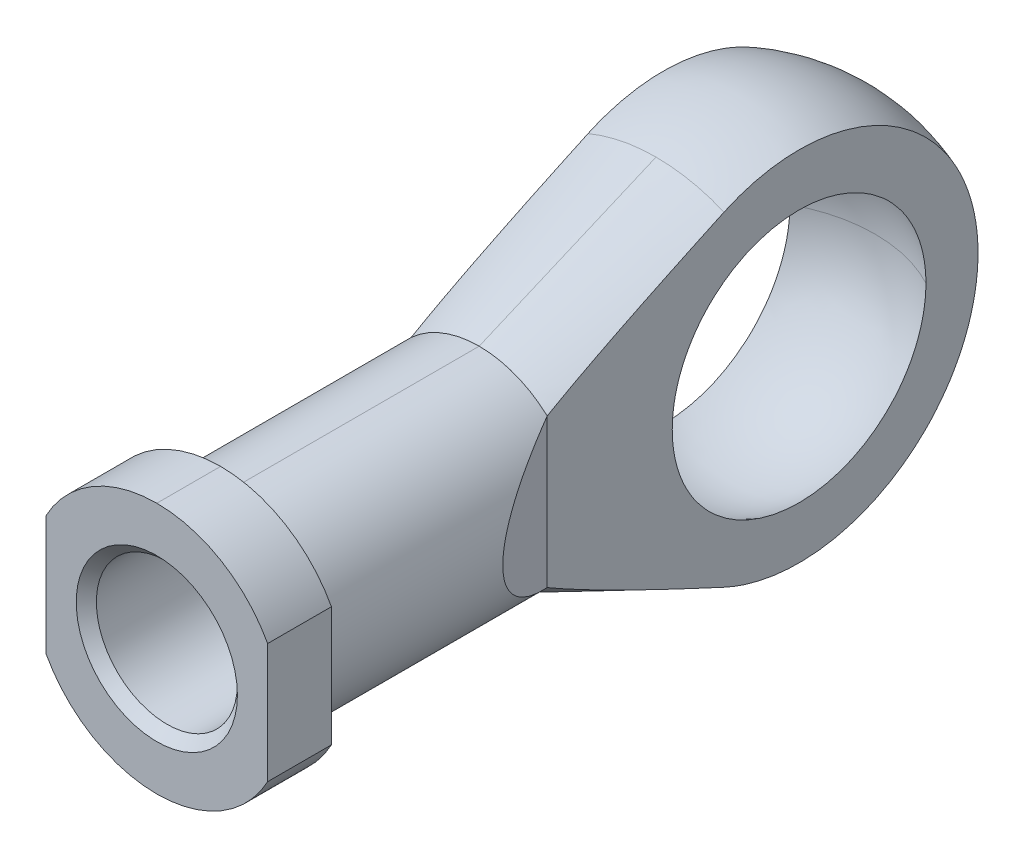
ISO-10303-21;
HEADER;
FILE_DESCRIPTION(('STEP AP214'),'2;1');
FILE_NAME('part.step','',(''),(''),'','','');
FILE_SCHEMA(('AUTOMOTIVE_DESIGN { 1 0 10303 214 1 1 1 1 }'));
ENDSEC;
DATA;
#1=APPLICATION_CONTEXT('core data for automotive mechanical design processes');
#2=APPLICATION_PROTOCOL_DEFINITION('international standard','automotive_design',2000,#1);
#3=PRODUCT_CONTEXT('',#1,'mechanical');
#4=PRODUCT('Part','Part','',(#3));
#5=PRODUCT_RELATED_PRODUCT_CATEGORY('part','',(#4));
#6=PRODUCT_DEFINITION_FORMATION('','',#4);
#7=PRODUCT_DEFINITION_CONTEXT('part definition',#1,'design');
#8=PRODUCT_DEFINITION('design','',#6,#7);
#9=PRODUCT_DEFINITION_SHAPE('','',#8);
#10=(LENGTH_UNIT() NAMED_UNIT(*) SI_UNIT(.MILLI.,.METRE.));
#11=(NAMED_UNIT(*) PLANE_ANGLE_UNIT() SI_UNIT($,.RADIAN.));
#12=(NAMED_UNIT(*) SI_UNIT($,.STERADIAN.) SOLID_ANGLE_UNIT());
#13=UNCERTAINTY_MEASURE_WITH_UNIT(LENGTH_MEASURE(1.E-05),#10,'distance_accuracy_value','');
#14=(GEOMETRIC_REPRESENTATION_CONTEXT(3) GLOBAL_UNCERTAINTY_ASSIGNED_CONTEXT((#13)) GLOBAL_UNIT_ASSIGNED_CONTEXT((#10,
#11,#12)) REPRESENTATION_CONTEXT('',''));
#15=CARTESIAN_POINT('',(0.,0.,0.));
#16=DIRECTION('',(0.,0.,1.));
#17=DIRECTION('',(1.,0.,0.));
#18=AXIS2_PLACEMENT_3D('',#15,#16,#17);
#19=CARTESIAN_POINT('',(0.,0.,0.));
#20=DIRECTION('',(0.,0.,1.));
#21=DIRECTION('',(0.,1.,0.));
#22=AXIS2_PLACEMENT_3D('',#19,#20,#21);
#23=SPHERICAL_SURFACE('',#22,14.285);
#24=CARTESIAN_POINT('',(0.,0.,-14.285));
#25=CARTESIAN_POINT('',(0.146466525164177,2.73466092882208E-12,-14.2850007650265));
#26=CARTESIAN_POINT('',(0.292933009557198,5.1271369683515E-12,-14.2827474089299));
#27=CARTESIAN_POINT('',(0.585727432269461,9.29072543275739E-12,-14.2737379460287));
#28=CARTESIAN_POINT('',(0.732055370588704,1.10618378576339E-11,-14.266981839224));
#29=CARTESIAN_POINT('',(1.02443423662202,1.40457052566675E-11,-14.2489723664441));
#30=CARTESIAN_POINT('',(1.17048516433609,1.52584602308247E-11,-14.2377190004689));
#31=CARTESIAN_POINT('',(1.46217184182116,1.71892170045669E-11,-14.2107258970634));
#32=CARTESIAN_POINT('',(1.60780759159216,1.79072188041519E-11,-14.194986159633));
#33=CARTESIAN_POINT('',(1.89852612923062,1.89150284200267E-11,-14.1590351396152));
#34=CARTESIAN_POINT('',(2.04360891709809,1.92048362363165E-11,-14.1388238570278));
#35=CARTESIAN_POINT('',(2.33308427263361,1.94184179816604E-11,-14.0939488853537));
#36=CARTESIAN_POINT('',(2.47747684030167,1.93421919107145E-11,-14.069285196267));
#37=CARTESIAN_POINT('',(2.76543514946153,1.88925265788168E-11,-14.015528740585));
#38=CARTESIAN_POINT('',(2.90900089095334,1.85190873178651E-11,-13.9864359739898));
#39=CARTESIAN_POINT('',(3.1951697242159,1.7538803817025E-11,-13.9238488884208));
#40=CARTESIAN_POINT('',(3.33777281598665,1.69319595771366E-11,-13.890354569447));
#41=CARTESIAN_POINT('',(3.62188143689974,1.55500962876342E-11,-13.8189960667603));
#42=CARTESIAN_POINT('',(3.76338696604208,1.47750772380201E-11,-13.7811318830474));
#43=CARTESIAN_POINT('',(4.04516658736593,1.31245573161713E-11,-13.7010694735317));
#44=CARTESIAN_POINT('',(4.18544067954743,1.22490564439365E-11,-13.6588712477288));
#45=CARTESIAN_POINT('',(4.46462471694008,1.04597155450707E-11,-13.5701806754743));
#46=CARTESIAN_POINT('',(4.60353466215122,9.54587551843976E-12,-13.5236883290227));
#47=CARTESIAN_POINT('',(4.87985898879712,7.74468969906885E-12,-13.4264535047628));
#48=CARTESIAN_POINT('',(5.01727337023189,6.85734390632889E-12,-13.3757110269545));
#49=CARTESIAN_POINT('',(5.29047655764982,5.17059163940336E-12,-13.2700239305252));
#50=CARTESIAN_POINT('',(5.42626536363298,4.37118516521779E-12,-13.2150793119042));
#51=CARTESIAN_POINT('',(5.69608896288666,2.92708302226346E-12,-13.1010399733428));
#52=CARTESIAN_POINT('',(5.83012375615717,2.28238735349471E-12,-13.0419452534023));
#53=CARTESIAN_POINT('',(6.09631241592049,1.20045405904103E-12,-12.9196614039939));
#54=CARTESIAN_POINT('',(6.2284662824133,7.63216433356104E-13,-12.8564722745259));
#55=CARTESIAN_POINT('',(6.49076846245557,1.60796965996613E-13,-12.726060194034));
#56=CARTESIAN_POINT('',(6.62091677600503,0.,-12.6588372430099));
#57=CARTESIAN_POINT('',(6.74999999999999,0.,-12.5896276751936));
#58=B_SPLINE_CURVE_WITH_KNOTS('',3,(#24,#25,#26,#27,#28,#29,#30,#31,#32,#33,#34,#35,#36,#37,#38,
#39,#40,#41,#42,#43,#44,#45,#46,#47,#48,#49,#50,#51,#52,#53,#54,#55,#56,#57),.UNSPECIFIED.,.F.,
.F.,(4,2,2,2,2,2,2,2,2,2,2,2,2,2,2,2,4),(0.,0.439382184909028,0.878764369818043,
1.31814655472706,1.75752873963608,2.19691092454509,2.63629310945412,3.07567529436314,
3.51505747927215,3.95443966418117,4.39382184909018,4.8332040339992,5.27258621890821,
5.71196840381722,6.15135058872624,6.59073277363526,7.03011495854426),.UNSPECIFIED.);
#59=CARTESIAN_POINT('',(0.,0.,-14.285));
#60=VERTEX_POINT('',#59);
#61=CARTESIAN_POINT('',(6.75,0.,-12.5896276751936));
#62=VERTEX_POINT('',#61);
#63=EDGE_CURVE('E325',#60,#62,#58,.T.);
#64=ORIENTED_EDGE('',*,*,#63,.T.);
#65=CARTESIAN_POINT('',(6.75,0.,-12.5896276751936));
#66=CARTESIAN_POINT('',(6.75,0.354096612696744,-12.5896657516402));
#67=CARTESIAN_POINT('',(6.75,0.708187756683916,-12.5746902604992));
#68=CARTESIAN_POINT('',(6.75,1.41383660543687,-12.5149871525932));
#69=CARTESIAN_POINT('',(6.75,1.76539443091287,-12.4702609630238));
#70=CARTESIAN_POINT('',(6.75,2.46322484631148,-12.3513763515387));
#71=CARTESIAN_POINT('',(6.75,2.80950122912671,-12.2772401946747));
#72=CARTESIAN_POINT('',(6.75,3.49457727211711,-12.1000749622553));
#73=CARTESIAN_POINT('',(6.75,3.83337702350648,-11.9970462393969));
#74=CARTESIAN_POINT('',(6.75,4.50125999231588,-11.7627670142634));
#75=CARTESIAN_POINT('',(6.75,4.83033839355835,-11.6315027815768));
#76=CARTESIAN_POINT('',(6.75,5.47626631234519,-11.3417163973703));
#77=CARTESIAN_POINT('',(6.75,5.79311582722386,-11.1831942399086));
#78=CARTESIAN_POINT('',(6.75,6.41227904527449,-10.8400488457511));
#79=CARTESIAN_POINT('',(6.75,6.71459526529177,-10.6554301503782));
#80=CARTESIAN_POINT('',(6.75,7.30260029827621,-10.2613843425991));
#81=CARTESIAN_POINT('',(6.75,7.58828920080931,-10.0519573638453));
#82=CARTESIAN_POINT('',(6.75,8.14100794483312,-9.60978496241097));
#83=CARTESIAN_POINT('',(6.75,8.40803796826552,-9.37703976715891));
#84=CARTESIAN_POINT('',(6.75,8.92154533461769,-8.88988232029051));
#85=CARTESIAN_POINT('',(6.75,9.16802256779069,-8.6354699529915));
#86=CARTESIAN_POINT('',(6.75,9.63871815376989,-8.10673430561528));
#87=CARTESIAN_POINT('',(6.75,9.86293202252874,-7.83240703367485));
#88=CARTESIAN_POINT('',(6.75,10.2874468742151,-7.26584221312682));
#89=CARTESIAN_POINT('',(6.75,10.4877482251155,-6.97360494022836));
#90=CARTESIAN_POINT('',(6.75,10.8630554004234,-6.3732330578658));
#91=CARTESIAN_POINT('',(6.75,11.0380561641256,-6.06509528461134));
#92=CARTESIAN_POINT('',(6.75,11.3614705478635,-5.43517006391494));
#93=CARTESIAN_POINT('',(6.75,11.5098839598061,-5.11338250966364));
#94=CARTESIAN_POINT('',(6.75,11.7790040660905,-4.45858670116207));
#95=CARTESIAN_POINT('',(6.75,11.8997237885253,-4.12558380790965));
#96=CARTESIAN_POINT('',(6.75,12.1126574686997,-3.45072441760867));
#97=CARTESIAN_POINT('',(6.75,12.2048782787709,-3.10887007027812));
#98=CARTESIAN_POINT('',(6.75,12.384545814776,-2.31028931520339));
#99=CARTESIAN_POINT('',(6.75,12.4614489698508,-1.85112209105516));
#100=CARTESIAN_POINT('',(6.75,12.5383435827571,-1.15871700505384));
#101=CARTESIAN_POINT('',(6.75,12.5575650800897,-0.92744005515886));
#102=CARTESIAN_POINT('',(6.75,12.5832073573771,-0.464127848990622));
#103=CARTESIAN_POINT('',(6.75,12.5896253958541,-0.232092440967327));
#104=CARTESIAN_POINT('',(6.75,12.5896276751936,0.));
#105=B_SPLINE_CURVE_WITH_KNOTS('',3,(#65,#66,#67,#68,#69,#70,#71,#72,#73,#74,#75,#76,#77,#78,
#79,#80,#81,#82,#83,#84,#85,#86,#87,#88,#89,#90,#91,#92,#93,#94,#95,#96,#97,#98,#99,#100,#101,
#102,#103,#104),.UNSPECIFIED.,.F.,.F.,(4,2,2,2,2,2,2,2,2,2,2,2,2,2,2,2,2,2,2,4),(0.,
1.06196559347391,2.12388024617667,3.18499249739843,4.24609179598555,5.30770825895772,
6.36932495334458,7.43075713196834,8.49218359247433,9.5535997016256,10.615021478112,
11.6766566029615,12.7382753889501,13.8001062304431,14.8619453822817,15.9232839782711,
16.9843671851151,18.3778155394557,19.0737413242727,19.7698161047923),.UNSPECIFIED.);
#106=CARTESIAN_POINT('',(6.75,12.5896276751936,0.));
#107=VERTEX_POINT('',#106);
#108=EDGE_CURVE('E302',#62,#107,#105,.T.);
#109=ORIENTED_EDGE('',*,*,#108,.T.);
#110=CARTESIAN_POINT('',(6.75,12.5896276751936,0.));
#111=CARTESIAN_POINT('',(6.75,12.5896657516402,0.354096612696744));
#112=CARTESIAN_POINT('',(6.75,12.5746902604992,0.708187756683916));
#113=CARTESIAN_POINT('',(6.75,12.5149871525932,1.41383660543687));
#114=CARTESIAN_POINT('',(6.75,12.4702609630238,1.76539443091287));
#115=CARTESIAN_POINT('',(6.75,12.3513763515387,2.46322484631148));
#116=CARTESIAN_POINT('',(6.75,12.2772401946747,2.80950122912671));
#117=CARTESIAN_POINT('',(6.75,12.1000749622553,3.4945772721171));
#118=CARTESIAN_POINT('',(6.75,11.9970462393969,3.83337702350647));
#119=CARTESIAN_POINT('',(6.75,11.7627670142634,4.50125999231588));
#120=CARTESIAN_POINT('',(6.75,11.6315027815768,4.83033839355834));
#121=CARTESIAN_POINT('',(6.75,11.3417163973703,5.47626631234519));
#122=CARTESIAN_POINT('',(6.75,11.1831942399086,5.79311582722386));
#123=CARTESIAN_POINT('',(6.75,10.8400488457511,6.41227904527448));
#124=CARTESIAN_POINT('',(6.75,10.6554301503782,6.71459526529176));
#125=CARTESIAN_POINT('',(6.75,10.2613843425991,7.30260029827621));
#126=CARTESIAN_POINT('',(6.75,10.0519573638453,7.58828920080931));
#127=CARTESIAN_POINT('',(6.75,9.60978496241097,8.14100794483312));
#128=CARTESIAN_POINT('',(6.75,9.37703976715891,8.40803796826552));
#129=CARTESIAN_POINT('',(6.75,8.88988232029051,8.92154533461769));
#130=CARTESIAN_POINT('',(6.75,8.6354699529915,9.16802256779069));
#131=CARTESIAN_POINT('',(6.75,8.10673430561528,9.63871815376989));
#132=CARTESIAN_POINT('',(6.75,7.83240703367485,9.86293202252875));
#133=CARTESIAN_POINT('',(6.75,7.26584221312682,10.2874468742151));
#134=CARTESIAN_POINT('',(6.75,6.97360494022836,10.4877482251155));
#135=CARTESIAN_POINT('',(6.75,6.3732330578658,10.8630554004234));
#136=CARTESIAN_POINT('',(6.75,6.06509528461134,11.0380561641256));
#137=CARTESIAN_POINT('',(6.75,5.43517006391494,11.3614705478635));
#138=CARTESIAN_POINT('',(6.75,5.11338250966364,11.5098839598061));
#139=CARTESIAN_POINT('',(6.75,4.45858670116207,11.7790040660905));
#140=CARTESIAN_POINT('',(6.75,4.12558380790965,11.8997237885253));
#141=CARTESIAN_POINT('',(6.75,3.45072441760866,12.1126574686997));
#142=CARTESIAN_POINT('',(6.75,3.10887007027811,12.2048782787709));
#143=CARTESIAN_POINT('',(6.75,2.31028931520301,12.384545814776));
#144=CARTESIAN_POINT('',(6.75,1.85112209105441,12.4614489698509));
#145=CARTESIAN_POINT('',(6.75,1.15871700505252,12.5383435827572));
#146=CARTESIAN_POINT('',(6.75,0.927440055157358,12.5575650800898));
#147=CARTESIAN_POINT('',(6.75,0.464127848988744,12.5832073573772));
#148=CARTESIAN_POINT('',(6.75,0.232092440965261,12.5896253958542));
#149=CARTESIAN_POINT('',(6.75,-2.24970044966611E-12,12.5896276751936));
#150=B_SPLINE_CURVE_WITH_KNOTS('',3,(#110,#111,#112,#113,#114,#115,#116,#117,#118,#119,#120,
#121,#122,#123,#124,#125,#126,#127,#128,#129,#130,#131,#132,#133,#134,#135,#136,#137,#138,#139,
#140,#141,#142,#143,#144,#145,#146,#147,#148,#149),.UNSPECIFIED.,.F.,.F.,(4,2,2,2,2,2,2,2,2,2,2,
2,2,2,2,2,2,2,2,4),(0.,1.06196559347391,2.12388024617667,3.18499249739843,4.24609179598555,
5.30770825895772,6.36932495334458,7.43075713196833,8.49218359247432,9.5535997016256,
10.615021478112,11.6766566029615,12.7382753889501,13.8001062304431,14.8619453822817,
15.9232839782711,16.9843671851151,18.3778155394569,19.0737413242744,19.7698161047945),.UNSPECIFIED.);
#151=CARTESIAN_POINT('',(6.75,-7.86407985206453E-12,12.5896276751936));
#152=VERTEX_POINT('',#151);
#153=EDGE_CURVE('E495',#107,#152,#150,.T.);
#154=ORIENTED_EDGE('',*,*,#153,.T.);
#155=CARTESIAN_POINT('',(0.,0.,0.));
#156=DIRECTION('',(1.99680877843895E-12,1.,0.));
#157=DIRECTION('',(0.,0.,1.));
#158=AXIS2_PLACEMENT_3D('',#155,#156,#157);
#159=CIRCLE('',#158,14.285);
#160=CARTESIAN_POINT('',(0.,0.,14.285));
#161=VERTEX_POINT('',#160);
#162=EDGE_CURVE('E506',#152,#161,#159,.F.);
#163=ORIENTED_EDGE('',*,*,#162,.T.);
#164=CARTESIAN_POINT('',(0.,0.,14.285));
#165=CARTESIAN_POINT('',(-0.146466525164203,-2.73512979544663E-12,14.2850007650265));
#166=CARTESIAN_POINT('',(-0.292933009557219,-5.12808124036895E-12,14.2827474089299));
#167=CARTESIAN_POINT('',(-0.585727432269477,-9.29242508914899E-12,14.2737379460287));
#168=CARTESIAN_POINT('',(-0.732055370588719,-1.10638174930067E-11,14.266981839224));
#169=CARTESIAN_POINT('',(-1.02443423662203,-1.40478409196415E-11,14.2489723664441));
#170=CARTESIAN_POINT('',(-1.1704851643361,-1.52604719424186E-11,14.2377190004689));
#171=CARTESIAN_POINT('',(-1.46217184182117,-1.71916196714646E-11,14.2107258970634));
#172=CARTESIAN_POINT('',(-1.60780759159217,-1.79101363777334E-11,14.194986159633));
#173=CARTESIAN_POINT('',(-1.89852612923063,-1.89172116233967E-11,14.1590351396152));
#174=CARTESIAN_POINT('',(-2.0436089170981,-1.92057701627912E-11,14.1388238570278));
#175=CARTESIAN_POINT('',(-2.33308427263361,-1.94189918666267E-11,14.0939488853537));
#176=CARTESIAN_POINT('',(-2.47747684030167,-1.93436550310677E-11,14.069285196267));
#177=CARTESIAN_POINT('',(-2.76543514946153,-1.88940338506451E-11,14.015528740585));
#178=CARTESIAN_POINT('',(-2.90900089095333,-1.85197495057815E-11,13.9864359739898));
#179=CARTESIAN_POINT('',(-3.19516972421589,-1.75388891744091E-11,13.9238488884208));
#180=CARTESIAN_POINT('',(-3.33777281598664,-1.69323131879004E-11,13.890354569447));
#181=CARTESIAN_POINT('',(-3.62188143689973,-1.55505949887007E-11,13.8189960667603));
#182=CARTESIAN_POINT('',(-3.76338696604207,-1.47754527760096E-11,13.7811318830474));
#183=CARTESIAN_POINT('',(-4.04516658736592,-1.31234042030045E-11,13.7010694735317));
#184=CARTESIAN_POINT('',(-4.18544067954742,-1.22464978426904E-11,13.6588712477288));
#185=CARTESIAN_POINT('',(-4.46462471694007,-1.04556506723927E-11,13.5701806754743));
#186=CARTESIAN_POINT('',(-4.60353466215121,-9.54170986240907E-12,13.5236883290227));
#187=CARTESIAN_POINT('',(-4.87985898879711,-7.7394880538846E-12,13.4264535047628));
#188=CARTESIAN_POINT('',(-5.01727337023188,-6.85120705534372E-12,13.3757110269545));
#189=CARTESIAN_POINT('',(-5.29047655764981,-5.16425814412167E-12,13.2700239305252));
#190=CARTESIAN_POINT('',(-5.42626536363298,-4.3655902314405E-12,13.2150793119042));
#191=CARTESIAN_POINT('',(-5.69608896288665,-2.91922209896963E-12,13.1010399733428));
#192=CARTESIAN_POINT('',(-5.83012375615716,-2.27152187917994E-12,13.0419452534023));
#193=CARTESIAN_POINT('',(-6.09631241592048,-1.18894629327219E-12,12.9196614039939));
#194=CARTESIAN_POINT('',(-6.22846628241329,-7.54070927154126E-13,12.8564722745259));
#195=CARTESIAN_POINT('',(-6.49076846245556,-1.54554704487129E-13,12.726060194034));
#196=CARTESIAN_POINT('',(-6.62091677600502,0.,12.6588372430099));
#197=CARTESIAN_POINT('',(-6.74999999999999,0.,12.5896276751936));
#198=B_SPLINE_CURVE_WITH_KNOTS('',3,(#164,#165,#166,#167,#168,#169,#170,#171,#172,#173,#174,
#175,#176,#177,#178,#179,#180,#181,#182,#183,#184,#185,#186,#187,#188,#189,#190,#191,#192,#193,
#194,#195,#196,#197),.UNSPECIFIED.,.F.,.F.,(4,2,2,2,2,2,2,2,2,2,2,2,2,2,2,2,4),(0.,
0.439382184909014,0.878764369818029,1.31814655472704,1.75752873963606,2.19691092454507,
2.63629310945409,3.0756752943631,3.51505747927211,3.95443966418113,4.39382184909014,
4.83320403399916,5.27258621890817,5.71196840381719,6.1513505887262,6.59073277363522,
7.03011495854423),.UNSPECIFIED.);
#199=CARTESIAN_POINT('',(-6.75,-2.24745221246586E-12,12.5896276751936));
#200=VERTEX_POINT('',#199);
#201=EDGE_CURVE('E112',#161,#200,#198,.T.);
#202=ORIENTED_EDGE('',*,*,#201,.T.);
#203=CARTESIAN_POINT('',(-6.75,-2.24820162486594E-12,12.5896276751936));
#204=CARTESIAN_POINT('',(-6.75,0.354087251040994,12.5896657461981));
#205=CARTESIAN_POINT('',(-6.75,0.708169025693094,12.5746910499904));
#206=CARTESIAN_POINT('',(-6.75,1.41379936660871,12.5149910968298));
#207=CARTESIAN_POINT('',(-6.75,1.7653480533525,12.4702672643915));
#208=CARTESIAN_POINT('',(-6.75,2.46317900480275,12.3513857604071));
#209=CARTESIAN_POINT('',(-6.75,2.80946479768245,12.2772488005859));
#210=CARTESIAN_POINT('',(-6.75,3.49455934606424,12.1000804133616));
#211=CARTESIAN_POINT('',(-6.75,3.8333681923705,11.9970493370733));
#212=CARTESIAN_POINT('',(-6.75,4.5012634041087,11.7627658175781));
#213=CARTESIAN_POINT('',(-6.75,4.83034511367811,11.6315001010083));
#214=CARTESIAN_POINT('',(-6.75,5.47627934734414,11.3417102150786));
#215=CARTESIAN_POINT('',(-6.75,5.79313186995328,11.1831860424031));
#216=CARTESIAN_POINT('',(-6.75,6.41229435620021,10.8400396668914));
#217=CARTESIAN_POINT('',(-6.75,6.7146071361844,10.6554225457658));
#218=CARTESIAN_POINT('',(-6.75,7.30260586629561,10.2613802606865));
#219=CARTESIAN_POINT('',(-6.75,7.58829189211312,10.05195520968));
#220=CARTESIAN_POINT('',(-6.75,8.14101443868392,9.6097797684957));
#221=CARTESIAN_POINT('',(-6.75,8.40805052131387,9.37702883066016));
#222=CARTESIAN_POINT('',(-6.75,8.92156807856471,8.88985977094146));
#223=CARTESIAN_POINT('',(-6.75,9.16804951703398,8.63544161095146));
#224=CARTESIAN_POINT('',(-6.75,9.63874097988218,8.10670673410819));
#225=CARTESIAN_POINT('',(-6.75,9.86294761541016,7.8323870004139));
#226=CARTESIAN_POINT('',(-6.75,10.2874525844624,7.2658338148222));
#227=CARTESIAN_POINT('',(-6.75,10.4877509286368,6.97360037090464));
#228=CARTESIAN_POINT('',(-6.75,10.8630069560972,6.3733107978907));
#229=CARTESIAN_POINT('',(-6.75,11.0379657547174,6.06525536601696));
#230=CARTESIAN_POINT('',(-6.75,11.3613092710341,5.43550018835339));
#231=CARTESIAN_POINT('',(-6.75,11.5096939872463,5.11380044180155));
#232=CARTESIAN_POINT('',(-6.75,11.7788256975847,4.45906490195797));
#233=CARTESIAN_POINT('',(-6.75,11.8995744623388,4.12602983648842));
#234=CARTESIAN_POINT('',(-6.75,12.112588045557,3.45097166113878));
#235=CARTESIAN_POINT('',(-6.75,12.204852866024,3.10894855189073));
#236=CARTESIAN_POINT('',(-6.75,12.3602442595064,2.41833859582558));
#237=CARTESIAN_POINT('',(-6.75,12.4233702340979,2.06975161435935));
#238=CARTESIAN_POINT('',(-6.75,12.520032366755,1.36849891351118));
#239=CARTESIAN_POINT('',(-6.75,12.5535685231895,1.01583319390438));
#240=CARTESIAN_POINT('',(-6.75,12.5908130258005,0.308922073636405));
#241=CARTESIAN_POINT('',(-6.75,12.5945206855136,-0.0453233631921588));
#242=CARTESIAN_POINT('',(-6.75,12.5720800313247,-0.752867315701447));
#243=CARTESIAN_POINT('',(-6.75,12.5459317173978,-1.10616583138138));
#244=CARTESIAN_POINT('',(-6.75,12.4639654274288,-1.80930065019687));
#245=CARTESIAN_POINT('',(-6.75,12.4081477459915,-2.15913698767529));
#246=CARTESIAN_POINT('',(-6.75,12.2672397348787,-2.85286387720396));
#247=CARTESIAN_POINT('',(-6.75,12.1821494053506,-3.19675442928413));
#248=CARTESIAN_POINT('',(-6.75,11.983301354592,-3.87614381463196));
#249=CARTESIAN_POINT('',(-6.75,11.8695437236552,-4.21164267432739));
#250=CARTESIAN_POINT('',(-6.75,11.614169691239,-4.87186459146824));
#251=CARTESIAN_POINT('',(-6.75,11.4725532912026,-5.19658764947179));
#252=CARTESIAN_POINT('',(-6.75,11.1624644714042,-5.83295771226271));
#253=CARTESIAN_POINT('',(-6.75,10.9939913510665,-6.1446043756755));
#254=CARTESIAN_POINT('',(-6.75,10.631389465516,-6.75259704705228));
#255=CARTESIAN_POINT('',(-6.75,10.4372606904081,-7.04894304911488));
#256=CARTESIAN_POINT('',(-6.75,10.0247377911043,-7.62421333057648));
#257=CARTESIAN_POINT('',(-6.75,9.80634484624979,-7.90313845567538));
#258=CARTESIAN_POINT('',(-6.75,9.34683892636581,-8.44159927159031));
#259=CARTESIAN_POINT('',(-6.75,9.10572599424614,-8.70113499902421));
#260=CARTESIAN_POINT('',(-6.75,8.60252843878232,-9.19893832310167));
#261=CARTESIAN_POINT('',(-6.75,8.3404467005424,-9.4372088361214));
#262=CARTESIAN_POINT('',(-6.75,7.79714331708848,-9.89083008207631));
#263=CARTESIAN_POINT('',(-6.75,7.51592152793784,-10.1061806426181));
#264=CARTESIAN_POINT('',(-6.75,6.93624280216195,-10.5124964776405));
#265=CARTESIAN_POINT('',(-6.75,6.63778020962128,-10.7034536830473));
#266=CARTESIAN_POINT('',(-6.75,6.02583609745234,-11.059536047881));
#267=CARTESIAN_POINT('',(-6.75,5.71235503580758,-11.2246619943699));
#268=CARTESIAN_POINT('',(-6.75,5.07239483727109,-11.5280097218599));
#269=CARTESIAN_POINT('',(-6.75,4.74590767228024,-11.6662145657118));
#270=CARTESIAN_POINT('',(-6.75,4.08244352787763,-11.9146063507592));
#271=CARTESIAN_POINT('',(-6.75,3.74546661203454,-12.0247934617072));
#272=CARTESIAN_POINT('',(-6.75,3.06387134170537,-12.2162423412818));
#273=CARTESIAN_POINT('',(-6.75,2.71926337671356,-12.2975411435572));
#274=CARTESIAN_POINT('',(-6.75,2.02456242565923,-12.4308032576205));
#275=CARTESIAN_POINT('',(-6.75,1.67447221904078,-12.4827809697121));
#276=CARTESIAN_POINT('',(-6.75,1.10301674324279,-12.5431649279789));
#277=CARTESIAN_POINT('',(-6.75,0.882566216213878,-12.5605995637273));
#278=CARTESIAN_POINT('',(-6.75,0.441418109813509,-12.583822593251));
#279=CARTESIAN_POINT('',(-6.75,0.220721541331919,-12.5896301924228));
#280=CARTESIAN_POINT('',(-6.75,0.,-12.5896276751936));
#281=B_SPLINE_CURVE_WITH_KNOTS('',3,(#203,#204,#205,#206,#207,#208,#209,#210,#211,#212,#213,
#214,#215,#216,#217,#218,#219,#220,#221,#222,#223,#224,#225,#226,#227,#228,#229,#230,#231,#232,
#233,#234,#235,#236,#237,#238,#239,#240,#241,#242,#243,#244,#245,#246,#247,#248,#249,#250,#251,
#252,#253,#254,#255,#256,#257,#258,#259,#260,#261,#262,#263,#264,#265,#266,#267,#268,#269,#270,
#271,#272,#273,#274,#275,#276,#277,#278,#279,#280),.UNSPECIFIED.,.F.,.F.,(4,2,2,2,2,2,2,2,2,2,2,
2,2,2,2,2,2,2,2,2,2,2,2,2,2,2,2,2,2,2,2,2,2,2,2,2,2,2,4),(0.,1.06193751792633,2.12382418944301,
3.18496443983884,4.24609179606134,5.30771909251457,6.36934651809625,7.43076747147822,
8.49218359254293,9.5536246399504,10.6150675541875,11.6766717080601,12.7382753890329,
13.7998323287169,14.8613893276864,15.9228782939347,16.9843671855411,18.0458778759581,
19.1073886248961,20.1689238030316,21.2304589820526,22.2919836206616,23.3535082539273,
24.4150295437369,25.4765507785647,26.5380997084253,27.5996490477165,28.661146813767,
29.7226425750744,30.7839925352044,31.8453504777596,32.907058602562,33.9687343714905,
35.0310759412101,36.0934110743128,37.1543793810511,38.214826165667,38.8779610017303,
39.539999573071),.UNSPECIFIED.);
#282=CARTESIAN_POINT('',(-6.75,0.,-12.5896276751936));
#283=VERTEX_POINT('',#282);
#284=EDGE_CURVE('E107',#200,#283,#281,.T.);
#285=ORIENTED_EDGE('',*,*,#284,.T.);
#286=CARTESIAN_POINT('',(0.,0.,0.));
#287=DIRECTION('',(0.,-1.,0.));
#288=DIRECTION('',(0.,0.,1.));
#289=AXIS2_PLACEMENT_3D('',#286,#287,#288);
#290=CIRCLE('',#289,14.285);
#291=EDGE_CURVE('E497',#283,#60,#290,.T.);
#292=ORIENTED_EDGE('',*,*,#291,.T.);
#293=EDGE_LOOP('',(#64,#109,#154,#163,#202,#285,#292));
#294=FACE_BOUND('',#293,.T.);
#295=ADVANCED_FACE('F14',(#294),#23,.F.);
#296=CARTESIAN_POINT('',(0.,0.,0.));
#297=DIRECTION('',(0.,0.,1.));
#298=DIRECTION('',(0.,1.,0.));
#299=AXIS2_PLACEMENT_3D('',#296,#297,#298);
#300=SPHERICAL_SURFACE('',#299,14.285);
#301=ORIENTED_EDGE('',*,*,#291,.F.);
#302=CARTESIAN_POINT('',(-6.75,0.,-12.5896276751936));
#303=CARTESIAN_POINT('',(-6.75,-0.354096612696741,-12.5896657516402));
#304=CARTESIAN_POINT('',(-6.75,-0.708187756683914,-12.5746902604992));
#305=CARTESIAN_POINT('',(-6.75,-1.41383660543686,-12.5149871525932));
#306=CARTESIAN_POINT('',(-6.75,-1.76539443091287,-12.4702609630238));
#307=CARTESIAN_POINT('',(-6.75,-2.46322484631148,-12.3513763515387));
#308=CARTESIAN_POINT('',(-6.75,-2.80950122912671,-12.2772401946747));
#309=CARTESIAN_POINT('',(-6.75,-3.4945772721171,-12.1000749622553));
#310=CARTESIAN_POINT('',(-6.75,-3.83337702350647,-11.9970462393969));
#311=CARTESIAN_POINT('',(-6.75,-4.50125999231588,-11.7627670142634));
#312=CARTESIAN_POINT('',(-6.75,-4.83033839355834,-11.6315027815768));
#313=CARTESIAN_POINT('',(-6.75,-5.47626631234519,-11.3417163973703));
#314=CARTESIAN_POINT('',(-6.75,-5.79311582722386,-11.1831942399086));
#315=CARTESIAN_POINT('',(-6.75,-6.41227904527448,-10.8400488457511));
#316=CARTESIAN_POINT('',(-6.75,-6.71459526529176,-10.6554301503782));
#317=CARTESIAN_POINT('',(-6.75,-7.30260029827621,-10.2613843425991));
#318=CARTESIAN_POINT('',(-6.75,-7.58828920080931,-10.0519573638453));
#319=CARTESIAN_POINT('',(-6.75,-8.14100794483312,-9.60978496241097));
#320=CARTESIAN_POINT('',(-6.75,-8.40803796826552,-9.37703976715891));
#321=CARTESIAN_POINT('',(-6.75,-8.9215453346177,-8.8898823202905));
#322=CARTESIAN_POINT('',(-6.75,-9.16802256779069,-8.6354699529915));
#323=CARTESIAN_POINT('',(-6.75,-9.63871815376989,-8.10673430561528));
#324=CARTESIAN_POINT('',(-6.75,-9.86293202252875,-7.83240703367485));
#325=CARTESIAN_POINT('',(-6.75,-10.2874468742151,-7.26584221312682));
#326=CARTESIAN_POINT('',(-6.75,-10.4877482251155,-6.97360494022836));
#327=CARTESIAN_POINT('',(-6.75,-10.8630554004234,-6.3732330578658));
#328=CARTESIAN_POINT('',(-6.75,-11.0380561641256,-6.06509528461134));
#329=CARTESIAN_POINT('',(-6.75,-11.3614705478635,-5.43517006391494));
#330=CARTESIAN_POINT('',(-6.75,-11.5098839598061,-5.11338250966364));
#331=CARTESIAN_POINT('',(-6.75,-11.7790040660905,-4.45858670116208));
#332=CARTESIAN_POINT('',(-6.75,-11.8997237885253,-4.12558380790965));
#333=CARTESIAN_POINT('',(-6.75,-12.1126574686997,-3.45072441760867));
#334=CARTESIAN_POINT('',(-6.75,-12.2048782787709,-3.10887007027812));
#335=CARTESIAN_POINT('',(-6.75,-12.384545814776,-2.31028931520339));
#336=CARTESIAN_POINT('',(-6.75,-12.4614489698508,-1.85112209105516));
#337=CARTESIAN_POINT('',(-6.75,-12.5383435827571,-1.15871700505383));
#338=CARTESIAN_POINT('',(-6.75,-12.5575650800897,-0.927440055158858));
#339=CARTESIAN_POINT('',(-6.75,-12.5832073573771,-0.46412784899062));
#340=CARTESIAN_POINT('',(-6.75,-12.5896253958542,-0.232092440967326));
#341=CARTESIAN_POINT('',(-6.75,-12.5896276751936,0.));
#342=B_SPLINE_CURVE_WITH_KNOTS('',3,(#302,#303,#304,#305,#306,#307,#308,#309,#310,#311,#312,
#313,#314,#315,#316,#317,#318,#319,#320,#321,#322,#323,#324,#325,#326,#327,#328,#329,#330,#331,
#332,#333,#334,#335,#336,#337,#338,#339,#340,#341),.UNSPECIFIED.,.F.,.F.,(4,2,2,2,2,2,2,2,2,2,2,
2,2,2,2,2,2,2,2,4),(0.,1.06196559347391,2.12388024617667,3.18499249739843,4.24609179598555,
5.30770825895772,6.36932495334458,7.43075713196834,8.49218359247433,9.5535997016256,
10.615021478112,11.6766566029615,12.7382753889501,13.8001062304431,14.8619453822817,
15.9232839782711,16.9843671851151,18.3778155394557,19.0737413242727,19.7698161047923),.UNSPECIFIED.);
#343=CARTESIAN_POINT('',(-6.75,-12.5896276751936,0.));
#344=VERTEX_POINT('',#343);
#345=EDGE_CURVE('E467',#283,#344,#342,.T.);
#346=ORIENTED_EDGE('',*,*,#345,.T.);
#347=CARTESIAN_POINT('',(-6.75,-12.5896276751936,0.));
#348=CARTESIAN_POINT('',(-6.75,-12.5896657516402,0.354096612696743));
#349=CARTESIAN_POINT('',(-6.75,-12.5746902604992,0.708187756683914));
#350=CARTESIAN_POINT('',(-6.75,-12.5149871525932,1.41383660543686));
#351=CARTESIAN_POINT('',(-6.75,-12.4702609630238,1.76539443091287));
#352=CARTESIAN_POINT('',(-6.75,-12.3513763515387,2.46322484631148));
#353=CARTESIAN_POINT('',(-6.75,-12.2772401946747,2.80950122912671));
#354=CARTESIAN_POINT('',(-6.75,-12.1000749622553,3.4945772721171));
#355=CARTESIAN_POINT('',(-6.75,-11.9970462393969,3.83337702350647));
#356=CARTESIAN_POINT('',(-6.75,-11.7627670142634,4.50125999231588));
#357=CARTESIAN_POINT('',(-6.75,-11.6315027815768,4.83033839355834));
#358=CARTESIAN_POINT('',(-6.75,-11.3417163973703,5.47626631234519));
#359=CARTESIAN_POINT('',(-6.75,-11.1831942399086,5.79311582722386));
#360=CARTESIAN_POINT('',(-6.75,-10.8400488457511,6.41227904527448));
#361=CARTESIAN_POINT('',(-6.75,-10.6554301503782,6.71459526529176));
#362=CARTESIAN_POINT('',(-6.75,-10.2613843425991,7.30260029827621));
#363=CARTESIAN_POINT('',(-6.75,-10.0519573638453,7.58828920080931));
#364=CARTESIAN_POINT('',(-6.75,-9.60978496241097,8.14100794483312));
#365=CARTESIAN_POINT('',(-6.75,-9.37703976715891,8.40803796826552));
#366=CARTESIAN_POINT('',(-6.75,-8.88988232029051,8.92154533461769));
#367=CARTESIAN_POINT('',(-6.75,-8.6354699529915,9.16802256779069));
#368=CARTESIAN_POINT('',(-6.75,-8.10673430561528,9.63871815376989));
#369=CARTESIAN_POINT('',(-6.75,-7.83240703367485,9.86293202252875));
#370=CARTESIAN_POINT('',(-6.75,-7.26584221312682,10.2874468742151));
#371=CARTESIAN_POINT('',(-6.75,-6.97360494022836,10.4877482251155));
#372=CARTESIAN_POINT('',(-6.75,-6.3732330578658,10.8630554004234));
#373=CARTESIAN_POINT('',(-6.75,-6.06509528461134,11.0380561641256));
#374=CARTESIAN_POINT('',(-6.75,-5.43517006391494,11.3614705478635));
#375=CARTESIAN_POINT('',(-6.75,-5.11338250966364,11.5098839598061));
#376=CARTESIAN_POINT('',(-6.75,-4.45858670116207,11.7790040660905));
#377=CARTESIAN_POINT('',(-6.75,-4.12558380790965,11.8997237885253));
#378=CARTESIAN_POINT('',(-6.75,-3.45072441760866,12.1126574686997));
#379=CARTESIAN_POINT('',(-6.75,-3.10887007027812,12.2048782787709));
#380=CARTESIAN_POINT('',(-6.75,-2.31028931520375,12.3845458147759));
#381=CARTESIAN_POINT('',(-6.75,-1.85112209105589,12.4614489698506));
#382=CARTESIAN_POINT('',(-6.75,-1.15871700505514,12.5383435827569));
#383=CARTESIAN_POINT('',(-6.75,-0.927440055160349,12.5575650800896));
#384=CARTESIAN_POINT('',(-6.75,-0.46412784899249,12.583207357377));
#385=CARTESIAN_POINT('',(-6.75,-0.232092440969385,12.5896253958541));
#386=CARTESIAN_POINT('',(-6.75,-2.24820162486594E-12,12.5896276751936));
#387=B_SPLINE_CURVE_WITH_KNOTS('',3,(#347,#348,#349,#350,#351,#352,#353,#354,#355,#356,#357,
#358,#359,#360,#361,#362,#363,#364,#365,#366,#367,#368,#369,#370,#371,#372,#373,#374,#375,#376,
#377,#378,#379,#380,#381,#382,#383,#384,#385,#386),.UNSPECIFIED.,.F.,.F.,(4,2,2,2,2,2,2,2,2,2,2,
2,2,2,2,2,2,2,2,4),(0.,1.06196559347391,2.12388024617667,3.18499249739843,4.24609179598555,
5.30770825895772,6.36932495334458,7.43075713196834,8.49218359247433,9.5535997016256,
10.615021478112,11.6766566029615,12.7382753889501,13.8001062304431,14.8619453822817,
15.9232839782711,16.9843671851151,18.3778155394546,19.073741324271,19.76981610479),.UNSPECIFIED.);
#388=EDGE_CURVE('E475',#344,#200,#387,.T.);
#389=ORIENTED_EDGE('',*,*,#388,.T.);
#390=ORIENTED_EDGE('',*,*,#201,.F.);
#391=ORIENTED_EDGE('',*,*,#162,.F.);
#392=CARTESIAN_POINT('',(6.75,-2.24970044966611E-12,12.5896276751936));
#393=CARTESIAN_POINT('',(6.75,-0.354087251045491,12.589665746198));
#394=CARTESIAN_POINT('',(6.75,-0.708169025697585,12.5746910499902));
#395=CARTESIAN_POINT('',(6.75,-1.41379936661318,12.5149910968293));
#396=CARTESIAN_POINT('',(6.75,-1.76534805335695,12.4702672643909));
#397=CARTESIAN_POINT('',(6.75,-2.46317900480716,12.3513857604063));
#398=CARTESIAN_POINT('',(6.75,-2.80946479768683,12.2772488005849));
#399=CARTESIAN_POINT('',(6.75,-3.49455934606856,12.1000804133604));
#400=CARTESIAN_POINT('',(6.75,-3.83336819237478,11.9970493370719));
#401=CARTESIAN_POINT('',(6.75,-4.5012634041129,11.7627658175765));
#402=CARTESIAN_POINT('',(6.75,-4.83034511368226,11.6315001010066));
#403=CARTESIAN_POINT('',(6.75,-5.47627934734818,11.3417102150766));
#404=CARTESIAN_POINT('',(6.75,-5.79313186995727,11.183186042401));
#405=CARTESIAN_POINT('',(6.75,-6.41229435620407,10.8400396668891));
#406=CARTESIAN_POINT('',(6.75,-6.7146071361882,10.6554225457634));
#407=CARTESIAN_POINT('',(6.75,-7.30260586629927,10.2613802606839));
#408=CARTESIAN_POINT('',(6.75,-7.58829189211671,10.0519552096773));
#409=CARTESIAN_POINT('',(6.75,-8.14101443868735,9.6097797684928));
#410=CARTESIAN_POINT('',(6.75,-8.40805052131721,9.37702883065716));
#411=CARTESIAN_POINT('',(6.75,-8.92156807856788,8.88985977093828));
#412=CARTESIAN_POINT('',(6.75,-9.16804951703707,8.63544161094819));
#413=CARTESIAN_POINT('',(6.75,-9.63874097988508,8.10670673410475));
#414=CARTESIAN_POINT('',(6.75,-9.86294761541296,7.83238700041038));
#415=CARTESIAN_POINT('',(6.75,-10.287452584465,7.26583381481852));
#416=CARTESIAN_POINT('',(6.75,-10.4877509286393,6.97360037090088));
#417=CARTESIAN_POINT('',(6.75,-10.8630069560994,6.37331079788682));
#418=CARTESIAN_POINT('',(6.75,-11.0379657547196,6.06525536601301));
#419=CARTESIAN_POINT('',(6.75,-11.361309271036,5.43550018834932));
#420=CARTESIAN_POINT('',(6.75,-11.5096939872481,5.11380044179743));
#421=CARTESIAN_POINT('',(6.75,-11.7788256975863,4.45906490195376));
#422=CARTESIAN_POINT('',(6.75,-11.8995744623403,4.12602983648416));
#423=CARTESIAN_POINT('',(6.75,-12.1125880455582,3.45097166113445));
#424=CARTESIAN_POINT('',(6.75,-12.2048528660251,3.10894855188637));
#425=CARTESIAN_POINT('',(6.75,-12.3602442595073,2.41833859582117));
#426=CARTESIAN_POINT('',(6.75,-12.4233702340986,2.06975161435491));
#427=CARTESIAN_POINT('',(6.75,-12.5200323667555,1.36849891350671));
#428=CARTESIAN_POINT('',(6.75,-12.5535685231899,1.0158331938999));
#429=CARTESIAN_POINT('',(6.75,-12.5908130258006,0.308922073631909));
#430=CARTESIAN_POINT('',(6.75,-12.5945206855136,-0.0453233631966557));
#431=CARTESIAN_POINT('',(6.75,-12.5720800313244,-0.752867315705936));
#432=CARTESIAN_POINT('',(6.75,-12.5459317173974,-1.10616583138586));
#433=CARTESIAN_POINT('',(6.75,-12.4639654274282,-1.80930065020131));
#434=CARTESIAN_POINT('',(6.75,-12.4081477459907,-2.15913698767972));
#435=CARTESIAN_POINT('',(6.75,-12.2672397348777,-2.85286387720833));
#436=CARTESIAN_POINT('',(6.75,-12.1821494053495,-3.19675442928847));
#437=CARTESIAN_POINT('',(6.75,-11.9833013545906,-3.87614381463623));
#438=CARTESIAN_POINT('',(6.75,-11.8695437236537,-4.21164267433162));
#439=CARTESIAN_POINT('',(6.75,-11.6141696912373,-4.87186459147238));
#440=CARTESIAN_POINT('',(6.75,-11.4725532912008,-5.19658764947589));
#441=CARTESIAN_POINT('',(6.75,-11.1624644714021,-5.83295771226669));
#442=CARTESIAN_POINT('',(6.75,-10.9939913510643,-6.14460437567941));
#443=CARTESIAN_POINT('',(6.75,-10.6313894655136,-6.75259704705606));
#444=CARTESIAN_POINT('',(6.75,-10.4372606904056,-7.0489430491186));
#445=CARTESIAN_POINT('',(6.75,-10.0247377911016,-7.62421333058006));
#446=CARTESIAN_POINT('',(6.75,-9.80634484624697,-7.90313845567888));
#447=CARTESIAN_POINT('',(6.75,-9.34683892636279,-8.44159927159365));
#448=CARTESIAN_POINT('',(6.75,-9.10572599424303,-8.70113499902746));
#449=CARTESIAN_POINT('',(6.75,-8.60252843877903,-9.19893832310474));
#450=CARTESIAN_POINT('',(6.75,-8.34044670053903,-9.43720883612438));
#451=CARTESIAN_POINT('',(6.75,-7.79714331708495,-9.8908300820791));
#452=CARTESIAN_POINT('',(6.75,-7.51592152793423,-10.1061806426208));
#453=CARTESIAN_POINT('',(6.75,-6.93624280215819,-10.512496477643));
#454=CARTESIAN_POINT('',(6.75,-6.63778020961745,-10.7034536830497));
#455=CARTESIAN_POINT('',(6.75,-6.02583609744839,-11.0595360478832));
#456=CARTESIAN_POINT('',(6.75,-5.71235503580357,-11.2246619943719));
#457=CARTESIAN_POINT('',(6.75,-5.07239483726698,-11.5280097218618));
#458=CARTESIAN_POINT('',(6.75,-4.74590767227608,-11.6662145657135));
#459=CARTESIAN_POINT('',(6.75,-4.08244352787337,-11.9146063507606));
#460=CARTESIAN_POINT('',(6.75,-3.74546661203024,-12.0247934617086));
#461=CARTESIAN_POINT('',(6.75,-3.06387134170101,-12.2162423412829));
#462=CARTESIAN_POINT('',(6.75,-2.71926337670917,-12.2975411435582));
#463=CARTESIAN_POINT('',(6.75,-2.0245624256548,-12.4308032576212));
#464=CARTESIAN_POINT('',(6.75,-1.67447221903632,-12.4827809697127));
#465=CARTESIAN_POINT('',(6.75,-1.10301674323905,-12.5431649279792));
#466=CARTESIAN_POINT('',(6.75,-0.882566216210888,-12.5605995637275));
#467=CARTESIAN_POINT('',(6.75,-0.441418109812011,-12.583822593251));
#468=CARTESIAN_POINT('',(6.75,-0.220721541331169,-12.5896301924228));
#469=CARTESIAN_POINT('',(6.75,0.,-12.5896276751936));
#470=B_SPLINE_CURVE_WITH_KNOTS('',3,(#392,#393,#394,#395,#396,#397,#398,#399,#400,#401,#402,
#403,#404,#405,#406,#407,#408,#409,#410,#411,#412,#413,#414,#415,#416,#417,#418,#419,#420,#421,
#422,#423,#424,#425,#426,#427,#428,#429,#430,#431,#432,#433,#434,#435,#436,#437,#438,#439,#440,
#441,#442,#443,#444,#445,#446,#447,#448,#449,#450,#451,#452,#453,#454,#455,#456,#457,#458,#459,
#460,#461,#462,#463,#464,#465,#466,#467,#468,#469),.UNSPECIFIED.,.F.,.F.,(4,2,2,2,2,2,2,2,2,2,2,
2,2,2,2,2,2,2,2,2,2,2,2,2,2,2,2,2,2,2,2,2,2,2,2,2,2,2,4),(0.,1.06193751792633,2.12382418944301,
3.18496443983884,4.24609179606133,5.30771909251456,6.36934651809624,7.43076747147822,
8.49218359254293,9.5536246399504,10.6150675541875,11.6766717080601,12.7382753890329,
13.7998323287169,14.8613893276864,15.9228782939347,16.9843671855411,18.0458778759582,
19.1073886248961,20.1689238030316,21.2304589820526,22.2919836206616,23.3535082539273,
24.4150295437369,25.4765507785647,26.5380997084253,27.5996490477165,28.661146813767,
29.7226425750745,30.7839925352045,31.8453504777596,32.907058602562,33.9687343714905,
35.0310759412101,36.0934110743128,37.1543793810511,38.214826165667,38.877961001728,
39.5399995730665),.UNSPECIFIED.);
#471=EDGE_CURVE('E303',#152,#62,#470,.T.);
#472=ORIENTED_EDGE('',*,*,#471,.T.);
#473=ORIENTED_EDGE('',*,*,#63,.F.);
#474=EDGE_LOOP('',(#301,#346,#389,#390,#391,#472,#473));
#475=FACE_BOUND('',#474,.T.);
#476=ADVANCED_FACE('F262',(#475),#300,.F.);
#477=CARTESIAN_POINT('',(6.75,38.,-32.));
#478=DIRECTION('',(-1.,0.,0.));
#479=DIRECTION('',(0.,0.,1.));
#480=AXIS2_PLACEMENT_3D('',#477,#478,#479);
#481=PLANE('',#480);
#482=CARTESIAN_POINT('',(6.75,0.,-17.7605602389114));
#483=CARTESIAN_POINT('',(6.75,-0.333011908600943,-17.7605708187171));
#484=CARTESIAN_POINT('',(6.75,-0.666022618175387,-17.7511946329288));
#485=CARTESIAN_POINT('',(6.75,-1.3309754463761,-17.7137457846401));
#486=CARTESIAN_POINT('',(6.75,-1.66291761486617,-17.6856740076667));
#487=CARTESIAN_POINT('',(6.75,-2.32469346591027,-17.6109116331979));
#488=CARTESIAN_POINT('',(6.75,-2.6545271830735,-17.5642213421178));
#489=CARTESIAN_POINT('',(6.75,-3.31082697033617,-17.4524111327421));
#490=CARTESIAN_POINT('',(6.75,-3.63729514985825,-17.3873035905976));
#491=CARTESIAN_POINT('',(6.75,-4.28605918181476,-17.2388491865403));
#492=CARTESIAN_POINT('',(6.75,-4.60835507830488,-17.1555025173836));
#493=CARTESIAN_POINT('',(6.75,-5.2477374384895,-16.9708427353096));
#494=CARTESIAN_POINT('',(6.75,-5.56482393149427,-16.8695297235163));
#495=CARTESIAN_POINT('',(6.75,-6.34998922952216,-16.5941057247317));
#496=CARTESIAN_POINT('',(6.75,-6.8142326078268,-16.4089343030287));
#497=CARTESIAN_POINT('',(6.75,-7.72554070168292,-16.0000920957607));
#498=CARTESIAN_POINT('',(6.75,-8.17260314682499,-15.776416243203));
#499=CARTESIAN_POINT('',(6.75,-8.82774401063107,-15.4133326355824));
#500=CARTESIAN_POINT('',(6.75,-9.04355700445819,-15.287704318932));
#501=CARTESIAN_POINT('',(6.75,-9.46963587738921,-15.0275012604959));
#502=CARTESIAN_POINT('',(6.75,-9.67990330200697,-14.8929290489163));
#503=CARTESIAN_POINT('',(6.75,-10.3019517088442,-14.4760622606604));
#504=CARTESIAN_POINT('',(6.75,-10.7050164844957,-14.1805966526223));
#505=CARTESIAN_POINT('',(6.75,-11.4847750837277,-13.5567995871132));
#506=CARTESIAN_POINT('',(6.75,-11.8614687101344,-13.228467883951));
#507=CARTESIAN_POINT('',(6.75,-12.5858756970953,-12.5412304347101));
#508=CARTESIAN_POINT('',(6.75,-12.9335890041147,-12.1823246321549));
#509=CARTESIAN_POINT('',(6.75,-13.5976132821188,-11.4364243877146));
#510=CARTESIAN_POINT('',(6.75,-13.9139176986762,-11.0494241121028));
#511=CARTESIAN_POINT('',(6.75,-14.5127975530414,-10.2501500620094));
#512=CARTESIAN_POINT('',(6.75,-14.7953730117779,-9.83787630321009));
#513=CARTESIAN_POINT('',(6.75,-15.3247814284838,-8.99099239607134));
#514=CARTESIAN_POINT('',(6.75,-15.5716147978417,-8.55638250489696));
#515=CARTESIAN_POINT('',(6.75,-16.0277883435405,-7.66791165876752));
#516=CARTESIAN_POINT('',(6.75,-16.2371284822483,-7.21405068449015));
#517=CARTESIAN_POINT('',(6.75,-16.6167915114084,-6.29039084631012));
#518=CARTESIAN_POINT('',(6.75,-16.7871216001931,-5.82059494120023));
#519=CARTESIAN_POINT('',(6.75,-17.0876027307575,-4.86832696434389));
#520=CARTESIAN_POINT('',(6.75,-17.2177539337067,-4.38585494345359));
#521=CARTESIAN_POINT('',(6.75,-17.4369565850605,-3.41164714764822));
#522=CARTESIAN_POINT('',(6.75,-17.5260067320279,-2.91991107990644));
#523=CARTESIAN_POINT('',(6.75,-17.6623690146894,-1.93067778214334));
#524=CARTESIAN_POINT('',(6.75,-17.7096805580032,-1.43318047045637));
#525=CARTESIAN_POINT('',(6.75,-17.7622310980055,-0.435905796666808));
#526=CARTESIAN_POINT('',(6.75,-17.7674646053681,0.0638718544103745));
#527=CARTESIAN_POINT('',(6.75,-17.7358062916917,1.06207468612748));
#528=CARTESIAN_POINT('',(6.75,-17.6989165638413,1.56049993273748));
#529=CARTESIAN_POINT('',(6.75,-17.5868285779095,2.52203897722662));
#530=CARTESIAN_POINT('',(6.75,-17.5141170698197,2.98544454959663));
#531=CARTESIAN_POINT('',(6.75,-17.3322773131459,3.90504153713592));
#532=CARTESIAN_POINT('',(6.75,-17.2231506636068,4.36123326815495));
#533=CARTESIAN_POINT('',(6.75,-16.9691337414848,5.26361411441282));
#534=CARTESIAN_POINT('',(6.75,-16.8242385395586,5.70980184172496));
#535=CARTESIAN_POINT('',(6.75,-16.4996320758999,6.58937078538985));
#536=CARTESIAN_POINT('',(6.75,-16.3199177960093,7.0227508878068));
#537=CARTESIAN_POINT('',(6.75,-16.1232766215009,7.44831866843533));
#538=B_SPLINE_CURVE_WITH_KNOTS('',3,(#482,#483,#484,#485,#486,#487,#488,#489,#490,#491,#492,
#493,#494,#495,#496,#497,#498,#499,#500,#501,#502,#503,#504,#505,#506,#507,#508,#509,#510,#511,
#512,#513,#514,#515,#516,#517,#518,#519,#520,#521,#522,#523,#524,#525,#526,#527,#528,#529,#530,
#531,#532,#533,#534,#535,#536,#537),.UNSPECIFIED.,.F.,.F.,(4,2,2,2,2,2,2,2,2,2,2,2,2,2,2,2,2,2,
2,2,2,2,2,2,2,2,2,4),(0.,0.998901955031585,1.9977565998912,2.99659480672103,3.99476339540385,
4.99292143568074,5.99107385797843,7.48866257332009,8.98644851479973,9.73540032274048,
10.4841411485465,11.9814940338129,13.4788581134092,14.9762249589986,16.4739036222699,
17.9715813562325,19.4692418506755,20.966903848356,22.4642892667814,23.9616686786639,
25.4590955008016,26.9565435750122,28.4541869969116,29.9517560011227,31.3575304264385,
32.7632431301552,34.1691496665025,35.5751781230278),.UNSPECIFIED.);
#539=CARTESIAN_POINT('',(6.75,0.,-17.7605602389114));
#540=VERTEX_POINT('',#539);
#541=CARTESIAN_POINT('',(6.75,-16.1232766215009,7.44831866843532));
#542=VERTEX_POINT('',#541);
#543=EDGE_CURVE('E552',#540,#542,#538,.T.);
#544=ORIENTED_EDGE('',*,*,#543,.F.);
#545=CARTESIAN_POINT('',(6.75,16.1232766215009,7.44831866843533));
#546=CARTESIAN_POINT('',(6.75,16.2629427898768,7.14601039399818));
#547=CARTESIAN_POINT('',(6.75,16.3940870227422,6.83976664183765));
#548=CARTESIAN_POINT('',(6.75,16.638954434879,6.2204084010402));
#549=CARTESIAN_POINT('',(6.75,16.7526784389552,5.90729423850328));
#550=CARTESIAN_POINT('',(6.75,16.9623397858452,5.27517177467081));
#551=CARTESIAN_POINT('',(6.75,17.0582774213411,4.95616357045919));
#552=CARTESIAN_POINT('',(6.75,17.2320097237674,4.31347544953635));
#553=CARTESIAN_POINT('',(6.75,17.3098165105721,3.98979880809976));
#554=CARTESIAN_POINT('',(6.75,17.4471224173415,3.3385841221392));
#555=CARTESIAN_POINT('',(6.75,17.5066217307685,3.01104611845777));
#556=CARTESIAN_POINT('',(6.75,17.6071254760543,2.35316464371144));
#557=CARTESIAN_POINT('',(6.75,17.6481300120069,2.02282118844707));
#558=CARTESIAN_POINT('',(6.75,17.7273743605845,1.19453183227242));
#559=CARTESIAN_POINT('',(6.75,17.7539648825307,0.695429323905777));
#560=CARTESIAN_POINT('',(6.75,17.7649913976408,-0.303326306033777));
#561=CARTESIAN_POINT('',(6.75,17.7494218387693,-0.802979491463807));
#562=CARTESIAN_POINT('',(6.75,17.6945587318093,-1.54999307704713));
#563=CARTESIAN_POINT('',(6.75,17.6710180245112,-1.7985962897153));
#564=CARTESIAN_POINT('',(6.75,17.613488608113,-2.29451886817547));
#565=CARTESIAN_POINT('',(6.75,17.5795028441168,-2.54183857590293));
#566=CARTESIAN_POINT('',(6.75,17.4619365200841,-3.28136565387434));
#567=CARTESIAN_POINT('',(6.75,17.36274376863,-3.77118392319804));
#568=CARTESIAN_POINT('',(6.75,17.1234629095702,-4.74066364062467));
#569=CARTESIAN_POINT('',(6.75,16.9833744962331,-5.22032501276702));
#570=CARTESIAN_POINT('',(6.75,16.6632885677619,-6.16616104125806));
#571=CARTESIAN_POINT('',(6.75,16.4832909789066,-6.6323356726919));
#572=CARTESIAN_POINT('',(6.75,16.0846272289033,-7.54795711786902));
#573=CARTESIAN_POINT('',(6.75,15.8659530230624,-7.99740042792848));
#574=CARTESIAN_POINT('',(6.75,15.391515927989,-8.8762664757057));
#575=CARTESIAN_POINT('',(6.75,15.1357530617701,-9.30568922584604));
#576=CARTESIAN_POINT('',(6.75,14.5889605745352,-10.141454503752));
#577=CARTESIAN_POINT('',(6.75,14.297931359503,-10.5477972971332));
#578=CARTESIAN_POINT('',(6.75,13.6826728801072,-11.3345194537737));
#579=CARTESIAN_POINT('',(6.75,13.3584435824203,-11.7148987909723));
#580=CARTESIAN_POINT('',(6.75,12.6791535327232,-12.4469210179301));
#581=CARTESIAN_POINT('',(6.75,12.324098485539,-12.7985692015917));
#582=CARTESIAN_POINT('',(6.75,11.5856307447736,-13.4707065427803));
#583=CARTESIAN_POINT('',(6.75,11.2022181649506,-13.7911958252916));
#584=CARTESIAN_POINT('',(6.75,10.4097470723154,-14.3987484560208));
#585=CARTESIAN_POINT('',(6.75,10.0006877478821,-14.6858107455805));
#586=CARTESIAN_POINT('',(6.75,9.15983519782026,-15.2244610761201));
#587=CARTESIAN_POINT('',(6.75,8.72804164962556,-15.4760486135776));
#588=CARTESIAN_POINT('',(6.75,7.84474055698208,-15.9419858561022));
#589=CARTESIAN_POINT('',(6.75,7.39323044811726,-16.1563306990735));
#590=CARTESIAN_POINT('',(6.75,6.47377175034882,-16.5462112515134));
#591=CARTESIAN_POINT('',(6.75,6.00582397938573,-16.7217488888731));
#592=CARTESIAN_POINT('',(6.75,5.08591904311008,-17.0232384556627));
#593=CARTESIAN_POINT('',(6.75,4.6347398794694,-17.1515702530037));
#594=CARTESIAN_POINT('',(6.75,3.72365842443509,-17.3721488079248));
#595=CARTESIAN_POINT('',(6.75,3.26375651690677,-17.4643971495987));
#596=CARTESIAN_POINT('',(6.75,2.33803487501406,-17.6122322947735));
#597=CARTESIAN_POINT('',(6.75,1.87221433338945,-17.6678140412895));
#598=CARTESIAN_POINT('',(6.75,0.937598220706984,-17.7420003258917));
#599=CARTESIAN_POINT('',(6.75,0.468802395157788,-17.7606016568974));
#600=CARTESIAN_POINT('',(6.75,0.,-17.7605602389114));
#601=B_SPLINE_CURVE_WITH_KNOTS('',3,(#545,#546,#547,#548,#549,#550,#551,#552,#553,#554,#555,
#556,#557,#558,#559,#560,#561,#562,#563,#564,#565,#566,#567,#568,#569,#570,#571,#572,#573,#574,
#575,#576,#577,#578,#579,#580,#581,#582,#583,#584,#585,#586,#587,#588,#589,#590,#591,#592,#593,
#594,#595,#596,#597,#598,#599,#600),.UNSPECIFIED.,.F.,.F.,(4,2,2,2,2,2,2,2,2,2,2,2,2,2,2,2,2,2,
2,2,2,2,2,2,2,2,2,4),(0.,0.998901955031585,1.9977565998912,2.99659480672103,3.99476339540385,
4.99292143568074,5.99107385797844,7.4886625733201,8.98644851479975,9.73540032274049,
10.4841411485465,11.981494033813,13.4788581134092,14.9762249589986,16.4739036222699,
17.9715813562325,19.4692418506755,20.966903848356,22.4642892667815,23.9616686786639,
25.4590955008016,26.9565435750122,28.4541869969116,29.9517560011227,31.3575304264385,
32.7632431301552,34.1691496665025,35.5751781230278),.UNSPECIFIED.);
#602=CARTESIAN_POINT('',(6.75,16.1232766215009,7.44831866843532));
#603=VERTEX_POINT('',#602);
#604=EDGE_CURVE('E483',#603,#540,#601,.T.);
#605=ORIENTED_EDGE('',*,*,#604,.F.);
#606=CARTESIAN_POINT('',(6.75,7.37817728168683,25.));
#607=CARTESIAN_POINT('',(6.75,7.52818902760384,24.7402243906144));
#608=CARTESIAN_POINT('',(6.75,7.67666643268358,24.479568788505));
#609=CARTESIAN_POINT('',(6.75,7.97092027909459,23.9567464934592));
#610=CARTESIAN_POINT('',(6.75,8.11669679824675,23.6945798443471));
#611=CARTESIAN_POINT('',(6.75,8.40590900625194,23.1689987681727));
#612=CARTESIAN_POINT('',(6.75,8.54934495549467,22.9055844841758));
#613=CARTESIAN_POINT('',(6.75,8.83417946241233,22.3776548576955));
#614=CARTESIAN_POINT('',(6.75,8.97557800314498,22.1131395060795));
#615=CARTESIAN_POINT('',(6.75,9.39701233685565,21.3183273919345));
#616=CARTESIAN_POINT('',(6.75,9.67437116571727,20.786610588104));
#617=CARTESIAN_POINT('',(6.75,10.2234710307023,19.7202704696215));
#618=CARTESIAN_POINT('',(6.75,10.4952118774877,19.1856470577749));
#619=CARTESIAN_POINT('',(6.75,11.0340293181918,18.1143743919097));
#620=CARTESIAN_POINT('',(6.75,11.3011080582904,17.5777262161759));
#621=CARTESIAN_POINT('',(6.75,11.8315505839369,16.5026069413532));
#622=CARTESIAN_POINT('',(6.75,12.0949144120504,15.9641358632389));
#623=CARTESIAN_POINT('',(6.75,12.6185766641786,14.8856591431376));
#624=CARTESIAN_POINT('',(6.75,12.8788748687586,14.3456533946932));
#625=CARTESIAN_POINT('',(6.75,13.3968784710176,13.2643994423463));
#626=CARTESIAN_POINT('',(6.75,13.6545838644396,12.7231512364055));
#627=CARTESIAN_POINT('',(6.75,14.0975378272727,11.7879348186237));
#628=CARTESIAN_POINT('',(6.75,14.2833074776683,11.3942131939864));
#629=CARTESIAN_POINT('',(6.75,14.6538017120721,10.6062903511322));
#630=CARTESIAN_POINT('',(6.75,14.838526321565,10.2120891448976));
#631=CARTESIAN_POINT('',(6.75,15.2070711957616,9.42318953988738));
#632=CARTESIAN_POINT('',(6.75,15.3908913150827,9.02849107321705));
#633=CARTESIAN_POINT('',(6.75,15.757692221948,8.23869262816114));
#634=CARTESIAN_POINT('',(6.75,15.9406729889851,7.84359264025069));
#635=CARTESIAN_POINT('',(6.75,16.1232766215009,7.44831866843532));
#636=B_SPLINE_CURVE_WITH_KNOTS('',3,(#606,#607,#608,#609,#610,#611,#612,#613,#614,#615,#616,
#617,#618,#619,#620,#621,#622,#623,#624,#625,#626,#627,#628,#629,#630,#631,#632,#633,#634,#635),
.UNSPECIFIED.,.F.,.F.,(4,2,2,2,2,2,2,2,2,2,2,2,2,2,4),(0.,0.899921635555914,1.79981730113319,
2.69961216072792,3.59941449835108,5.39849254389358,7.19763112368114,8.99591839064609,
10.7941850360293,12.5925796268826,14.3909771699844,15.6970169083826,17.0030246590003,
18.3092358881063,19.6154788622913),.UNSPECIFIED.);
#637=CARTESIAN_POINT('',(6.75,7.37817728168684,25.));
#638=VERTEX_POINT('',#637);
#639=EDGE_CURVE('E238',#638,#603,#636,.T.);
#640=ORIENTED_EDGE('',*,*,#639,.F.);
#641=DIRECTION('',(0.,1.,0.));
#642=VECTOR('',#641,1.);
#643=CARTESIAN_POINT('',(6.75,38.,25.));
#644=LINE('',#643,#642);
#645=CARTESIAN_POINT('',(6.75,-7.37817728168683,25.));
#646=VERTEX_POINT('',#645);
#647=EDGE_CURVE('E248',#638,#646,#644,.F.);
#648=ORIENTED_EDGE('',*,*,#647,.T.);
#649=CARTESIAN_POINT('',(6.75,-16.1232766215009,7.44831866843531));
#650=CARTESIAN_POINT('',(6.75,-15.7804817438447,8.19027839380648));
#651=CARTESIAN_POINT('',(6.75,-15.4364029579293,8.93164891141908));
#652=CARTESIAN_POINT('',(6.75,-14.7449805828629,10.4128588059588));
#653=CARTESIAN_POINT('',(6.75,-14.3976370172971,11.1526981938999));
#654=CARTESIAN_POINT('',(6.75,-13.6991243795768,12.6302051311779));
#655=CARTESIAN_POINT('',(6.75,-13.3479569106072,13.3678734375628));
#656=CARTESIAN_POINT('',(6.75,-12.6406573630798,14.8408484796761));
#657=CARTESIAN_POINT('',(6.75,-12.2845251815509,15.5761551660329));
#658=CARTESIAN_POINT('',(6.75,-11.5658251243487,17.0439360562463));
#659=CARTESIAN_POINT('',(6.75,-11.2032550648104,17.7764091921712));
#660=CARTESIAN_POINT('',(6.75,-10.4699073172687,19.2372014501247));
#661=CARTESIAN_POINT('',(6.75,-10.099130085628,19.9655208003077));
#662=CARTESIAN_POINT('',(6.75,-9.5345548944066,21.0538348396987));
#663=CARTESIAN_POINT('',(6.75,-9.34492007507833,21.4159891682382));
#664=CARTESIAN_POINT('',(6.75,-8.96235820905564,22.1385492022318));
#665=CARTESIAN_POINT('',(6.75,-8.76943121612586,22.498954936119));
#666=CARTESIAN_POINT('',(6.75,-8.37963968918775,23.217722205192));
#667=CARTESIAN_POINT('',(6.75,-8.18277443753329,23.5760833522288));
#668=CARTESIAN_POINT('',(6.75,-7.7842694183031,24.2901649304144));
#669=CARTESIAN_POINT('',(6.75,-7.58262938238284,24.6458852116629));
#670=CARTESIAN_POINT('',(6.75,-7.37817728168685,25.));
#671=B_SPLINE_CURVE_WITH_KNOTS('',3,(#649,#650,#651,#652,#653,#654,#655,#656,#657,#658,#659,
#660,#661,#662,#663,#664,#665,#666,#667,#668,#669,#670),.UNSPECIFIED.,.F.,.F.,(4,2,2,2,2,2,2,2,
2,2,4),(0.,2.45196526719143,4.90391283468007,7.35486922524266,9.80587652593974,12.2577317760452,
14.7094510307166,15.9358362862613,17.1622015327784,18.3887923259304,19.6154522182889),.UNSPECIFIED.);
#672=EDGE_CURVE('E250',#542,#646,#671,.T.);
#673=ORIENTED_EDGE('',*,*,#672,.F.);
#674=EDGE_LOOP('',(#544,#605,#640,#648,#673));
#675=FACE_BOUND('',#674,.T.);
#676=ORIENTED_EDGE('',*,*,#471,.F.);
#677=ORIENTED_EDGE('',*,*,#153,.F.);
#678=ORIENTED_EDGE('',*,*,#108,.F.);
#679=EDGE_LOOP('',(#676,#677,#678));
#680=FACE_BOUND('',#679,.T.);
#681=ADVANCED_FACE('F256',(#675,#680),#481,.F.);
#682=CARTESIAN_POINT('',(0.,6.25,57.));
#683=DIRECTION('',(0.,0.,1.));
#684=DIRECTION('',(1.,0.,0.));
#685=AXIS2_PLACEMENT_3D('',#682,#683,#684);
#686=PLANE('',#685);
#687=CARTESIAN_POINT('',(0.,0.,57.));
#688=DIRECTION('',(0.,0.,1.));
#689=DIRECTION('',(1.,0.,0.));
#690=AXIS2_PLACEMENT_3D('',#687,#688,#689);
#691=CIRCLE('',#690,7.99999999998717);
#692=CARTESIAN_POINT('',(7.99999999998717,0.,57.));
#693=VERTEX_POINT('',#692);
#694=EDGE_CURVE('E23',#693,#693,#691,.F.);
#695=ORIENTED_EDGE('',*,*,#694,.T.);
#696=EDGE_LOOP('',(#695));
#697=FACE_BOUND('',#696,.T.);
#698=CARTESIAN_POINT('',(0.,0.,57.));
#699=DIRECTION('',(0.,0.,1.));
#700=DIRECTION('',(1.,0.,0.));
#701=AXIS2_PLACEMENT_3D('',#698,#699,#700);
#702=CIRCLE('',#701,12.5);
#703=CARTESIAN_POINT('',(0.,12.5,57.));
#704=VERTEX_POINT('',#703);
#705=CARTESIAN_POINT('',(11.,5.93717104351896,57.));
#706=VERTEX_POINT('',#705);
#707=EDGE_CURVE('E406',#704,#706,#702,.F.);
#708=ORIENTED_EDGE('',*,*,#707,.F.);
#709=CARTESIAN_POINT('',(0.,0.,57.));
#710=DIRECTION('',(0.,0.,1.));
#711=DIRECTION('',(1.,0.,0.));
#712=AXIS2_PLACEMENT_3D('',#709,#710,#711);
#713=CIRCLE('',#712,12.5);
#714=CARTESIAN_POINT('',(-11.,5.93717104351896,57.));
#715=VERTEX_POINT('',#714);
#716=EDGE_CURVE('E410',#715,#704,#713,.F.);
#717=ORIENTED_EDGE('',*,*,#716,.F.);
#718=DIRECTION('',(0.,1.,0.));
#719=VECTOR('',#718,1.);
#720=CARTESIAN_POINT('',(-11.,38.,57.));
#721=LINE('',#720,#719);
#722=CARTESIAN_POINT('',(-11.,-5.93717104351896,57.));
#723=VERTEX_POINT('',#722);
#724=EDGE_CURVE('E414',#715,#723,#721,.F.);
#725=ORIENTED_EDGE('',*,*,#724,.T.);
#726=CARTESIAN_POINT('',(0.,0.,57.));
#727=DIRECTION('',(0.,0.,1.));
#728=DIRECTION('',(1.,0.,0.));
#729=AXIS2_PLACEMENT_3D('',#726,#727,#728);
#730=CIRCLE('',#729,12.5);
#731=CARTESIAN_POINT('',(0.,-12.5,57.));
#732=VERTEX_POINT('',#731);
#733=EDGE_CURVE('E145',#732,#723,#730,.F.);
#734=ORIENTED_EDGE('',*,*,#733,.F.);
#735=CARTESIAN_POINT('',(0.,0.,57.));
#736=DIRECTION('',(0.,0.,1.));
#737=DIRECTION('',(1.,0.,0.));
#738=AXIS2_PLACEMENT_3D('',#735,#736,#737);
#739=CIRCLE('',#738,12.5);
#740=CARTESIAN_POINT('',(11.,-5.93717104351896,57.));
#741=VERTEX_POINT('',#740);
#742=EDGE_CURVE('E141',#741,#732,#739,.F.);
#743=ORIENTED_EDGE('',*,*,#742,.F.);
#744=DIRECTION('',(0.,1.,0.));
#745=VECTOR('',#744,1.);
#746=CARTESIAN_POINT('',(11.,38.,57.));
#747=LINE('',#746,#745);
#748=EDGE_CURVE('E403',#741,#706,#747,.T.);
#749=ORIENTED_EDGE('',*,*,#748,.T.);
#750=EDGE_LOOP('',(#708,#717,#725,#734,#743,#749));
#751=FACE_BOUND('',#750,.T.);
#752=ADVANCED_FACE('F261',(#697,#751),#686,.T.);
#753=CARTESIAN_POINT('',(0.,0.,0.));
#754=DIRECTION('',(0.,0.,1.));
#755=DIRECTION('',(0.,1.,0.));
#756=AXIS2_PLACEMENT_3D('',#753,#754,#755);
#757=SPHERICAL_SURFACE('',#756,19.);
#758=CARTESIAN_POINT('',(0.,0.,7.44831866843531));
#759=DIRECTION('',(0.,0.,-1.));
#760=DIRECTION('',(0.,1.,0.));
#761=AXIS2_PLACEMENT_3D('',#758,#759,#760);
#762=CIRCLE('',#761,17.4792033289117);
#763=CARTESIAN_POINT('',(0.,17.4792033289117,7.44831866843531));
#764=VERTEX_POINT('',#763);
#765=EDGE_CURVE('E247',#603,#764,#762,.F.);
#766=ORIENTED_EDGE('',*,*,#765,.F.);
#767=ORIENTED_EDGE('',*,*,#604,.T.);
#768=CARTESIAN_POINT('',(0.,0.,-19.));
#769=CARTESIAN_POINT('',(0.287530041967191,0.,-19.0000048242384));
#770=CARTESIAN_POINT('',(0.575059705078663,0.,-18.9934733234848));
#771=CARTESIAN_POINT('',(1.14952670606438,0.,-18.9673723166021));
#772=CARTESIAN_POINT('',(1.43646404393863,0.,-18.947802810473));
#773=CARTESIAN_POINT('',(2.00915482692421,0.,-18.8956604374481));
#774=CARTESIAN_POINT('',(2.29490827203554,0.,-18.8630875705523));
#775=CARTESIAN_POINT('',(2.8646424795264,0.,-18.7850071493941));
#776=CARTESIAN_POINT('',(3.14862324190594,0.,-18.7394995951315));
#777=CARTESIAN_POINT('',(3.71422681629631,0.,-18.6356430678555));
#778=CARTESIAN_POINT('',(3.99584962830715,0.,-18.577294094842));
#779=CARTESIAN_POINT('',(4.55615707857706,0.,-18.4478754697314));
#780=CARTESIAN_POINT('',(4.83484171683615,0.,-18.3768058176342));
#781=CARTESIAN_POINT('',(5.38869804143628,0.,-18.2220908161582));
#782=CARTESIAN_POINT('',(5.66386972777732,0.,-18.1384454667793));
#783=CARTESIAN_POINT('',(6.21013486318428,0.,-17.9587568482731));
#784=CARTESIAN_POINT('',(6.48122831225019,0.,-17.8627135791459));
#785=CARTESIAN_POINT('',(6.74999999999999,0.,-17.7605602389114));
#786=B_SPLINE_CURVE_WITH_KNOTS('',3,(#768,#769,#770,#771,#772,#773,#774,#775,#776,#777,#778,
#779,#780,#781,#782,#783,#784,#785),.UNSPECIFIED.,.F.,.F.,(4,2,2,2,2,2,2,2,4),(0.,
0.86251541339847,1.72503082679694,2.58754624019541,3.45006165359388,4.31257706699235,
5.17509248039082,6.03760789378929,6.90012330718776),.UNSPECIFIED.);
#787=CARTESIAN_POINT('',(0.,0.,-19.));
#788=VERTEX_POINT('',#787);
#789=EDGE_CURVE('E440',#788,#540,#786,.T.);
#790=ORIENTED_EDGE('',*,*,#789,.F.);
#791=CARTESIAN_POINT('',(0.,0.,0.));
#792=DIRECTION('',(0.,-1.,0.));
#793=DIRECTION('',(0.,0.,1.));
#794=AXIS2_PLACEMENT_3D('',#791,#792,#793);
#795=CIRCLE('',#794,19.);
#796=CARTESIAN_POINT('',(-6.75,0.,-17.7605602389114));
#797=VERTEX_POINT('',#796);
#798=EDGE_CURVE('E466',#797,#788,#795,.T.);
#799=ORIENTED_EDGE('',*,*,#798,.F.);
#800=CARTESIAN_POINT('',(-6.75,0.,-17.7605602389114));
#801=CARTESIAN_POINT('',(-6.75,0.333011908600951,-17.7605708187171));
#802=CARTESIAN_POINT('',(-6.75,0.666022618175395,-17.7511946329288));
#803=CARTESIAN_POINT('',(-6.75,1.33097544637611,-17.7137457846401));
#804=CARTESIAN_POINT('',(-6.75,1.66291761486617,-17.6856740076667));
#805=CARTESIAN_POINT('',(-6.75,2.32469346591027,-17.6109116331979));
#806=CARTESIAN_POINT('',(-6.75,2.65452718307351,-17.5642213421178));
#807=CARTESIAN_POINT('',(-6.75,3.31082697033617,-17.4524111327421));
#808=CARTESIAN_POINT('',(-6.75,3.63729514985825,-17.3873035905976));
#809=CARTESIAN_POINT('',(-6.75,4.28605918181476,-17.2388491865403));
#810=CARTESIAN_POINT('',(-6.75,4.60835507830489,-17.1555025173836));
#811=CARTESIAN_POINT('',(-6.75,5.24773743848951,-16.9708427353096));
#812=CARTESIAN_POINT('',(-6.75,5.56482393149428,-16.8695297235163));
#813=CARTESIAN_POINT('',(-6.75,6.34998922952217,-16.5941057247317));
#814=CARTESIAN_POINT('',(-6.75,6.81423260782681,-16.4089343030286));
#815=CARTESIAN_POINT('',(-6.75,7.72554070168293,-16.0000920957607));
#816=CARTESIAN_POINT('',(-6.75,8.172603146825,-15.776416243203));
#817=CARTESIAN_POINT('',(-6.75,8.82774401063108,-15.4133326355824));
#818=CARTESIAN_POINT('',(-6.75,9.0435570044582,-15.287704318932));
#819=CARTESIAN_POINT('',(-6.75,9.46963587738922,-15.0275012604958));
#820=CARTESIAN_POINT('',(-6.75,9.67990330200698,-14.8929290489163));
#821=CARTESIAN_POINT('',(-6.75,10.3019517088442,-14.4760622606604));
#822=CARTESIAN_POINT('',(-6.75,10.7050164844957,-14.1805966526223));
#823=CARTESIAN_POINT('',(-6.75,11.4847750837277,-13.5567995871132));
#824=CARTESIAN_POINT('',(-6.75,11.8614687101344,-13.228467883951));
#825=CARTESIAN_POINT('',(-6.75,12.5858756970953,-12.5412304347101));
#826=CARTESIAN_POINT('',(-6.75,12.9335890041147,-12.1823246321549));
#827=CARTESIAN_POINT('',(-6.75,13.5976132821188,-11.4364243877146));
#828=CARTESIAN_POINT('',(-6.75,13.9139176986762,-11.0494241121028));
#829=CARTESIAN_POINT('',(-6.75,14.5127975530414,-10.2501500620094));
#830=CARTESIAN_POINT('',(-6.75,14.7953730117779,-9.83787630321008));
#831=CARTESIAN_POINT('',(-6.75,15.3247814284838,-8.99099239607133));
#832=CARTESIAN_POINT('',(-6.75,15.5716147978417,-8.55638250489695));
#833=CARTESIAN_POINT('',(-6.75,16.0277883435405,-7.66791165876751));
#834=CARTESIAN_POINT('',(-6.75,16.2371284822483,-7.21405068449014));
#835=CARTESIAN_POINT('',(-6.75,16.6167915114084,-6.29039084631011));
#836=CARTESIAN_POINT('',(-6.75,16.7871216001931,-5.82059494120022));
#837=CARTESIAN_POINT('',(-6.75,17.0876027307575,-4.86832696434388));
#838=CARTESIAN_POINT('',(-6.75,17.2177539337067,-4.38585494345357));
#839=CARTESIAN_POINT('',(-6.75,17.4369565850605,-3.41164714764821));
#840=CARTESIAN_POINT('',(-6.75,17.5260067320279,-2.91991107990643));
#841=CARTESIAN_POINT('',(-6.75,17.6623690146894,-1.93067778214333));
#842=CARTESIAN_POINT('',(-6.75,17.7096805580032,-1.43318047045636));
#843=CARTESIAN_POINT('',(-6.75,17.7622310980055,-0.435905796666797));
#844=CARTESIAN_POINT('',(-6.75,17.7674646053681,0.0638718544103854));
#845=CARTESIAN_POINT('',(-6.75,17.7358062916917,1.06207468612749));
#846=CARTESIAN_POINT('',(-6.75,17.6989165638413,1.56049993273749));
#847=CARTESIAN_POINT('',(-6.75,17.5868285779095,2.52203897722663));
#848=CARTESIAN_POINT('',(-6.75,17.5141170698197,2.98544454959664));
#849=CARTESIAN_POINT('',(-6.75,17.3322773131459,3.90504153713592));
#850=CARTESIAN_POINT('',(-6.75,17.2231506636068,4.36123326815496));
#851=CARTESIAN_POINT('',(-6.75,16.9691337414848,5.26361411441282));
#852=CARTESIAN_POINT('',(-6.75,16.8242385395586,5.70980184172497));
#853=CARTESIAN_POINT('',(-6.75,16.4996320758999,6.58937078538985));
#854=CARTESIAN_POINT('',(-6.75,16.3199177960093,7.0227508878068));
#855=CARTESIAN_POINT('',(-6.75,16.1232766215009,7.44831866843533));
#856=B_SPLINE_CURVE_WITH_KNOTS('',3,(#800,#801,#802,#803,#804,#805,#806,#807,#808,#809,#810,
#811,#812,#813,#814,#815,#816,#817,#818,#819,#820,#821,#822,#823,#824,#825,#826,#827,#828,#829,
#830,#831,#832,#833,#834,#835,#836,#837,#838,#839,#840,#841,#842,#843,#844,#845,#846,#847,#848,
#849,#850,#851,#852,#853,#854,#855),.UNSPECIFIED.,.F.,.F.,(4,2,2,2,2,2,2,2,2,2,2,2,2,2,2,2,2,2,
2,2,2,2,2,2,2,2,2,4),(0.,0.998901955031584,1.99775659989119,2.99659480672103,3.99476339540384,
4.99292143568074,5.99107385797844,7.48866257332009,8.98644851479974,9.73540032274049,
10.4841411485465,11.9814940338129,13.4788581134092,14.9762249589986,16.4739036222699,
17.9715813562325,19.4692418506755,20.966903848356,22.4642892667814,23.9616686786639,
25.4590955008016,26.9565435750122,28.4541869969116,29.9517560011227,31.3575304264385,
32.7632431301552,34.1691496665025,35.5751781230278),.UNSPECIFIED.);
#857=CARTESIAN_POINT('',(-6.75,16.1232766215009,7.44831866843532));
#858=VERTEX_POINT('',#857);
#859=EDGE_CURVE('E459',#797,#858,#856,.T.);
#860=ORIENTED_EDGE('',*,*,#859,.T.);
#861=CARTESIAN_POINT('',(0.,0.,7.44831866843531));
#862=DIRECTION('',(0.,0.,-1.));
#863=DIRECTION('',(0.,1.,0.));
#864=AXIS2_PLACEMENT_3D('',#861,#862,#863);
#865=CIRCLE('',#864,17.4792033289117);
#866=EDGE_CURVE('E398',#764,#858,#865,.F.);
#867=ORIENTED_EDGE('',*,*,#866,.F.);
#868=EDGE_LOOP('',(#766,#767,#790,#799,#860,#867));
#869=FACE_BOUND('',#868,.T.);
#870=ADVANCED_FACE('F452',(#869),#757,.T.);
#871=CARTESIAN_POINT('',(-6.75,38.,25.));
#872=DIRECTION('',(1.,0.,0.));
#873=DIRECTION('',(0.,0.,-1.));
#874=AXIS2_PLACEMENT_3D('',#871,#872,#873);
#875=PLANE('',#874);
#876=ORIENTED_EDGE('',*,*,#859,.F.);
#877=CARTESIAN_POINT('',(-6.75,-16.1232766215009,7.44831866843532));
#878=CARTESIAN_POINT('',(-6.75,-16.2629427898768,7.14601039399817));
#879=CARTESIAN_POINT('',(-6.75,-16.3940870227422,6.83976664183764));
#880=CARTESIAN_POINT('',(-6.75,-16.638954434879,6.22040840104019));
#881=CARTESIAN_POINT('',(-6.75,-16.7526784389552,5.90729423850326));
#882=CARTESIAN_POINT('',(-6.75,-16.9623397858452,5.2751717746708));
#883=CARTESIAN_POINT('',(-6.75,-17.0582774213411,4.95616357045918));
#884=CARTESIAN_POINT('',(-6.75,-17.2320097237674,4.31347544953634));
#885=CARTESIAN_POINT('',(-6.75,-17.3098165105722,3.98979880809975));
#886=CARTESIAN_POINT('',(-6.75,-17.4471224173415,3.3385841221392));
#887=CARTESIAN_POINT('',(-6.75,-17.5066217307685,3.01104611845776));
#888=CARTESIAN_POINT('',(-6.75,-17.6071254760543,2.35316464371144));
#889=CARTESIAN_POINT('',(-6.75,-17.6481300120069,2.02282118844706));
#890=CARTESIAN_POINT('',(-6.75,-17.7273743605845,1.19453183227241));
#891=CARTESIAN_POINT('',(-6.75,-17.7539648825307,0.695429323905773));
#892=CARTESIAN_POINT('',(-6.75,-17.7649913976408,-0.30332630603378));
#893=CARTESIAN_POINT('',(-6.75,-17.7494218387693,-0.80297949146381));
#894=CARTESIAN_POINT('',(-6.75,-17.6945587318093,-1.54999307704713));
#895=CARTESIAN_POINT('',(-6.75,-17.6710180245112,-1.79859628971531));
#896=CARTESIAN_POINT('',(-6.75,-17.613488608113,-2.29451886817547));
#897=CARTESIAN_POINT('',(-6.75,-17.5795028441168,-2.54183857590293));
#898=CARTESIAN_POINT('',(-6.75,-17.4619365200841,-3.28136565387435));
#899=CARTESIAN_POINT('',(-6.75,-17.36274376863,-3.77118392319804));
#900=CARTESIAN_POINT('',(-6.75,-17.1234629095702,-4.74066364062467));
#901=CARTESIAN_POINT('',(-6.75,-16.9833744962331,-5.22032501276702));
#902=CARTESIAN_POINT('',(-6.75,-16.6632885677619,-6.16616104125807));
#903=CARTESIAN_POINT('',(-6.75,-16.4832909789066,-6.63233567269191));
#904=CARTESIAN_POINT('',(-6.75,-16.0846272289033,-7.54795711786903));
#905=CARTESIAN_POINT('',(-6.75,-15.8659530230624,-7.99740042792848));
#906=CARTESIAN_POINT('',(-6.75,-15.391515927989,-8.87626647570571));
#907=CARTESIAN_POINT('',(-6.75,-15.1357530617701,-9.30568922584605));
#908=CARTESIAN_POINT('',(-6.75,-14.5889605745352,-10.141454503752));
#909=CARTESIAN_POINT('',(-6.75,-14.297931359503,-10.5477972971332));
#910=CARTESIAN_POINT('',(-6.75,-13.6826728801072,-11.3345194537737));
#911=CARTESIAN_POINT('',(-6.75,-13.3584435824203,-11.7148987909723));
#912=CARTESIAN_POINT('',(-6.75,-12.6791535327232,-12.4469210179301));
#913=CARTESIAN_POINT('',(-6.75,-12.324098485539,-12.7985692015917));
#914=CARTESIAN_POINT('',(-6.75,-11.5856307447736,-13.4707065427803));
#915=CARTESIAN_POINT('',(-6.75,-11.2022181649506,-13.7911958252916));
#916=CARTESIAN_POINT('',(-6.75,-10.4097470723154,-14.3987484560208));
#917=CARTESIAN_POINT('',(-6.75,-10.0006877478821,-14.6858107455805));
#918=CARTESIAN_POINT('',(-6.75,-9.15983519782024,-15.2244610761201));
#919=CARTESIAN_POINT('',(-6.75,-8.72804164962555,-15.4760486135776));
#920=CARTESIAN_POINT('',(-6.75,-7.84474055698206,-15.9419858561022));
#921=CARTESIAN_POINT('',(-6.75,-7.39323044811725,-16.1563306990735));
#922=CARTESIAN_POINT('',(-6.75,-6.47377175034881,-16.5462112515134));
#923=CARTESIAN_POINT('',(-6.75,-6.00582397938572,-16.7217488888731));
#924=CARTESIAN_POINT('',(-6.75,-5.08591904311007,-17.0232384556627));
#925=CARTESIAN_POINT('',(-6.75,-4.6347398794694,-17.1515702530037));
#926=CARTESIAN_POINT('',(-6.75,-3.72365842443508,-17.3721488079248));
#927=CARTESIAN_POINT('',(-6.75,-3.26375651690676,-17.4643971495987));
#928=CARTESIAN_POINT('',(-6.75,-2.33803487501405,-17.6122322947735));
#929=CARTESIAN_POINT('',(-6.75,-1.87221433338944,-17.6678140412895));
#930=CARTESIAN_POINT('',(-6.75,-0.937598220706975,-17.7420003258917));
#931=CARTESIAN_POINT('',(-6.75,-0.468802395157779,-17.7606016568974));
#932=CARTESIAN_POINT('',(-6.75,0.,-17.7605602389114));
#933=B_SPLINE_CURVE_WITH_KNOTS('',3,(#877,#878,#879,#880,#881,#882,#883,#884,#885,#886,#887,
#888,#889,#890,#891,#892,#893,#894,#895,#896,#897,#898,#899,#900,#901,#902,#903,#904,#905,#906,
#907,#908,#909,#910,#911,#912,#913,#914,#915,#916,#917,#918,#919,#920,#921,#922,#923,#924,#925,
#926,#927,#928,#929,#930,#931,#932),.UNSPECIFIED.,.F.,.F.,(4,2,2,2,2,2,2,2,2,2,2,2,2,2,2,2,2,2,
2,2,2,2,2,2,2,2,2,4),(0.,0.998901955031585,1.9977565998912,2.99659480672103,3.99476339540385,
4.99292143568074,5.99107385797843,7.48866257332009,8.98644851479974,9.73540032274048,
10.4841411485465,11.9814940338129,13.4788581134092,14.9762249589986,16.4739036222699,
17.9715813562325,19.4692418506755,20.966903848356,22.4642892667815,23.9616686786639,
25.4590955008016,26.9565435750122,28.4541869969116,29.9517560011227,31.3575304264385,
32.7632431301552,34.1691496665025,35.5751781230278),.UNSPECIFIED.);
#934=CARTESIAN_POINT('',(-6.75,-16.1232766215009,7.44831866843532));
#935=VERTEX_POINT('',#934);
#936=EDGE_CURVE('E550',#935,#797,#933,.T.);
#937=ORIENTED_EDGE('',*,*,#936,.F.);
#938=CARTESIAN_POINT('',(-6.75,-7.37817728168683,25.));
#939=CARTESIAN_POINT('',(-6.75,-7.52818902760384,24.7402243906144));
#940=CARTESIAN_POINT('',(-6.75,-7.67666643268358,24.479568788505));
#941=CARTESIAN_POINT('',(-6.75,-7.97092027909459,23.9567464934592));
#942=CARTESIAN_POINT('',(-6.75,-8.11669679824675,23.6945798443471));
#943=CARTESIAN_POINT('',(-6.75,-8.40590900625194,23.1689987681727));
#944=CARTESIAN_POINT('',(-6.75,-8.54934495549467,22.9055844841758));
#945=CARTESIAN_POINT('',(-6.75,-8.83417946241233,22.3776548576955));
#946=CARTESIAN_POINT('',(-6.75,-8.97557800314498,22.1131395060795));
#947=CARTESIAN_POINT('',(-6.75,-9.39701233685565,21.3183273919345));
#948=CARTESIAN_POINT('',(-6.75,-9.67437116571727,20.786610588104));
#949=CARTESIAN_POINT('',(-6.75,-10.2234710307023,19.7202704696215));
#950=CARTESIAN_POINT('',(-6.75,-10.4952118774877,19.1856470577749));
#951=CARTESIAN_POINT('',(-6.75,-11.0340293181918,18.1143743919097));
#952=CARTESIAN_POINT('',(-6.75,-11.3011080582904,17.5777262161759));
#953=CARTESIAN_POINT('',(-6.75,-11.8315505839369,16.5026069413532));
#954=CARTESIAN_POINT('',(-6.75,-12.0949144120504,15.9641358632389));
#955=CARTESIAN_POINT('',(-6.75,-12.6185766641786,14.8856591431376));
#956=CARTESIAN_POINT('',(-6.75,-12.8788748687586,14.3456533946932));
#957=CARTESIAN_POINT('',(-6.75,-13.3968784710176,13.2643994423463));
#958=CARTESIAN_POINT('',(-6.75,-13.6545838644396,12.7231512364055));
#959=CARTESIAN_POINT('',(-6.75,-14.0975378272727,11.7879348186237));
#960=CARTESIAN_POINT('',(-6.75,-14.2833074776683,11.3942131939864));
#961=CARTESIAN_POINT('',(-6.75,-14.6538017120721,10.6062903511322));
#962=CARTESIAN_POINT('',(-6.75,-14.838526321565,10.2120891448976));
#963=CARTESIAN_POINT('',(-6.75,-15.2070711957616,9.42318953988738));
#964=CARTESIAN_POINT('',(-6.75,-15.3908913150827,9.02849107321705));
#965=CARTESIAN_POINT('',(-6.75,-15.757692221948,8.23869262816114));
#966=CARTESIAN_POINT('',(-6.75,-15.9406729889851,7.84359264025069));
#967=CARTESIAN_POINT('',(-6.75,-16.1232766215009,7.44831866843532));
#968=B_SPLINE_CURVE_WITH_KNOTS('',3,(#938,#939,#940,#941,#942,#943,#944,#945,#946,#947,#948,
#949,#950,#951,#952,#953,#954,#955,#956,#957,#958,#959,#960,#961,#962,#963,#964,#965,#966,#967),
.UNSPECIFIED.,.F.,.F.,(4,2,2,2,2,2,2,2,2,2,2,2,2,2,4),(0.,0.899921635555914,1.79981730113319,
2.69961216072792,3.59941449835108,5.39849254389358,7.19763112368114,8.99591839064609,
10.7941850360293,12.5925796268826,14.3909771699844,15.6970169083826,17.0030246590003,
18.3092358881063,19.6154788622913),.UNSPECIFIED.);
#969=CARTESIAN_POINT('',(-6.75,-7.37817728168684,25.));
#970=VERTEX_POINT('',#969);
#971=EDGE_CURVE('E172',#970,#935,#968,.T.);
#972=ORIENTED_EDGE('',*,*,#971,.F.);
#973=DIRECTION('',(0.,1.,0.));
#974=VECTOR('',#973,1.);
#975=CARTESIAN_POINT('',(-6.75,38.,25.));
#976=LINE('',#975,#974);
#977=CARTESIAN_POINT('',(-6.75,7.37817728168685,25.));
#978=VERTEX_POINT('',#977);
#979=EDGE_CURVE('E391',#970,#978,#976,.T.);
#980=ORIENTED_EDGE('',*,*,#979,.T.);
#981=CARTESIAN_POINT('',(-6.75,16.1232766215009,7.44831866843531));
#982=CARTESIAN_POINT('',(-6.75,15.7804817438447,8.19027839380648));
#983=CARTESIAN_POINT('',(-6.75,15.4364029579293,8.93164891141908));
#984=CARTESIAN_POINT('',(-6.75,14.7449805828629,10.4128588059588));
#985=CARTESIAN_POINT('',(-6.75,14.3976370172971,11.1526981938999));
#986=CARTESIAN_POINT('',(-6.75,13.6991243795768,12.6302051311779));
#987=CARTESIAN_POINT('',(-6.75,13.3479569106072,13.3678734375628));
#988=CARTESIAN_POINT('',(-6.75,12.6406573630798,14.8408484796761));
#989=CARTESIAN_POINT('',(-6.75,12.2845251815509,15.5761551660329));
#990=CARTESIAN_POINT('',(-6.75,11.5658251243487,17.0439360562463));
#991=CARTESIAN_POINT('',(-6.75,11.2032550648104,17.7764091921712));
#992=CARTESIAN_POINT('',(-6.75,10.4699073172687,19.2372014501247));
#993=CARTESIAN_POINT('',(-6.75,10.099130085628,19.9655208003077));
#994=CARTESIAN_POINT('',(-6.75,9.5345548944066,21.0538348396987));
#995=CARTESIAN_POINT('',(-6.75,9.34492007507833,21.4159891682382));
#996=CARTESIAN_POINT('',(-6.75,8.96235820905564,22.1385492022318));
#997=CARTESIAN_POINT('',(-6.75,8.76943121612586,22.498954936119));
#998=CARTESIAN_POINT('',(-6.75,8.37963968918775,23.217722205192));
#999=CARTESIAN_POINT('',(-6.75,8.18277443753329,23.5760833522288));
#1000=CARTESIAN_POINT('',(-6.75,7.7842694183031,24.2901649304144));
#1001=CARTESIAN_POINT('',(-6.75,7.58262938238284,24.6458852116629));
#1002=CARTESIAN_POINT('',(-6.75,7.37817728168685,25.));
#1003=B_SPLINE_CURVE_WITH_KNOTS('',3,(#981,#982,#983,#984,#985,#986,#987,#988,#989,#990,#991,
#992,#993,#994,#995,#996,#997,#998,#999,#1000,#1001,#1002),.UNSPECIFIED.,.F.,.F.,(4,2,2,2,2,2,2,
2,2,2,4),(0.,2.45196526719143,4.90391283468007,7.35486922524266,9.80587652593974,
12.2577317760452,14.7094510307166,15.9358362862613,17.1622015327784,18.3887923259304,
19.6154522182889),.UNSPECIFIED.);
#1004=EDGE_CURVE('E183',#858,#978,#1003,.T.);
#1005=ORIENTED_EDGE('',*,*,#1004,.F.);
#1006=EDGE_LOOP('',(#876,#937,#972,#980,#1005));
#1007=FACE_BOUND('',#1006,.T.);
#1008=ORIENTED_EDGE('',*,*,#284,.F.);
#1009=ORIENTED_EDGE('',*,*,#388,.F.);
#1010=ORIENTED_EDGE('',*,*,#345,.F.);
#1011=EDGE_LOOP('',(#1008,#1009,#1010));
#1012=FACE_BOUND('',#1011,.T.);
#1013=ADVANCED_FACE('F190',(#1007,#1012),#875,.F.);
#1014=CARTESIAN_POINT('',(0.,0.,0.));
#1015=DIRECTION('',(0.,0.,1.));
#1016=DIRECTION('',(0.,1.,0.));
#1017=AXIS2_PLACEMENT_3D('',#1014,#1015,#1016);
#1018=SPHERICAL_SURFACE('',#1017,19.);
#1019=CARTESIAN_POINT('',(0.,0.,7.44831866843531));
#1020=DIRECTION('',(0.,0.,-1.));
#1021=DIRECTION('',(0.,1.,0.));
#1022=AXIS2_PLACEMENT_3D('',#1019,#1020,#1021);
#1023=CIRCLE('',#1022,17.4792033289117);
#1024=CARTESIAN_POINT('',(0.,-17.4792033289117,7.44831866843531));
#1025=VERTEX_POINT('',#1024);
#1026=EDGE_CURVE('E181',#935,#1025,#1023,.F.);
#1027=ORIENTED_EDGE('',*,*,#1026,.F.);
#1028=ORIENTED_EDGE('',*,*,#936,.T.);
#1029=ORIENTED_EDGE('',*,*,#798,.T.);
#1030=ORIENTED_EDGE('',*,*,#789,.T.);
#1031=ORIENTED_EDGE('',*,*,#543,.T.);
#1032=CARTESIAN_POINT('',(0.,0.,7.44831866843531));
#1033=DIRECTION('',(0.,0.,-1.));
#1034=DIRECTION('',(0.,1.,0.));
#1035=AXIS2_PLACEMENT_3D('',#1032,#1033,#1034);
#1036=CIRCLE('',#1035,17.4792033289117);
#1037=EDGE_CURVE('E551',#1025,#542,#1036,.F.);
#1038=ORIENTED_EDGE('',*,*,#1037,.F.);
#1039=EDGE_LOOP('',(#1027,#1028,#1029,#1030,#1031,#1038));
#1040=FACE_BOUND('',#1039,.T.);
#1041=ADVANCED_FACE('F420',(#1040),#1018,.T.);
#1042=CARTESIAN_POINT('',(0.,0.,7.4483186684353));
#1043=DIRECTION('',(0.,0.,-1.));
#1044=DIRECTION('',(-1.,0.,0.));
#1045=AXIS2_PLACEMENT_3D('',#1042,#1043,#1044);
#1046=CONICAL_SURFACE('',#1045,17.4792033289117,0.402822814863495);
#1047=ORIENTED_EDGE('',*,*,#672,.T.);
#1048=CARTESIAN_POINT('',(0.,0.,25.));
#1049=DIRECTION('',(0.,0.,1.));
#1050=DIRECTION('',(1.,0.,0.));
#1051=AXIS2_PLACEMENT_3D('',#1048,#1049,#1050);
#1052=CIRCLE('',#1051,10.);
#1053=CARTESIAN_POINT('',(0.,-10.,25.));
#1054=VERTEX_POINT('',#1053);
#1055=EDGE_CURVE('E171',#1054,#646,#1052,.T.);
#1056=ORIENTED_EDGE('',*,*,#1055,.F.);
#1057=DIRECTION('',(0.,0.392016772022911,0.919958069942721));
#1058=VECTOR('',#1057,1.);
#1059=CARTESIAN_POINT('',(0.,-13.7396016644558,16.2241593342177));
#1060=LINE('',#1059,#1058);
#1061=EDGE_CURVE('E182',#1025,#1054,#1060,.T.);
#1062=ORIENTED_EDGE('',*,*,#1061,.F.);
#1063=ORIENTED_EDGE('',*,*,#1037,.T.);
#1064=EDGE_LOOP('',(#1047,#1056,#1062,#1063));
#1065=FACE_BOUND('',#1064,.T.);
#1066=ADVANCED_FACE('F423',(#1065),#1046,.T.);
#1067=CARTESIAN_POINT('',(6.75,38.,25.));
#1068=DIRECTION('',(-0.92050485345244,0.,0.390731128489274));
#1069=DIRECTION('',(0.390731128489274,0.,0.92050485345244));
#1070=AXIS2_PLACEMENT_3D('',#1067,#1068,#1069);
#1071=PLANE('',#1070);
#1072=ORIENTED_EDGE('',*,*,#647,.F.);
#1073=CARTESIAN_POINT('',(0.,0.,9.09799653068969));
#1074=DIRECTION('',(-0.92050485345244,0.,0.390731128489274));
#1075=DIRECTION('',(0.390731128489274,0.,0.92050485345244));
#1076=AXIS2_PLACEMENT_3D('',#1073,#1074,#1075);
#1077=ELLIPSE('',#1076,25.5930466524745,10.);
#1078=EDGE_CURVE('E168',#646,#638,#1077,.T.);
#1079=ORIENTED_EDGE('',*,*,#1078,.F.);
#1080=EDGE_LOOP('',(#1072,#1079));
#1081=FACE_BOUND('',#1080,.T.);
#1082=ADVANCED_FACE('F234',(#1081),#1071,.F.);
#1083=CARTESIAN_POINT('',(0.,0.,7.4483186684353));
#1084=DIRECTION('',(0.,0.,-1.));
#1085=DIRECTION('',(-1.,0.,0.));
#1086=AXIS2_PLACEMENT_3D('',#1083,#1084,#1085);
#1087=CONICAL_SURFACE('',#1086,17.4792033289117,0.402822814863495);
#1088=ORIENTED_EDGE('',*,*,#639,.T.);
#1089=ORIENTED_EDGE('',*,*,#765,.T.);
#1090=DIRECTION('',(0.,-0.392016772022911,0.919958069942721));
#1091=VECTOR('',#1090,1.);
#1092=CARTESIAN_POINT('',(0.,13.7396016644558,16.2241593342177));
#1093=LINE('',#1092,#1091);
#1094=CARTESIAN_POINT('',(0.,10.,25.));
#1095=VERTEX_POINT('',#1094);
#1096=EDGE_CURVE('E395',#1095,#764,#1093,.F.);
#1097=ORIENTED_EDGE('',*,*,#1096,.F.);
#1098=CARTESIAN_POINT('',(0.,0.,25.));
#1099=DIRECTION('',(0.,0.,1.));
#1100=DIRECTION('',(1.,0.,0.));
#1101=AXIS2_PLACEMENT_3D('',#1098,#1099,#1100);
#1102=CIRCLE('',#1101,10.);
#1103=EDGE_CURVE('E164',#638,#1095,#1102,.T.);
#1104=ORIENTED_EDGE('',*,*,#1103,.F.);
#1105=EDGE_LOOP('',(#1088,#1089,#1097,#1104));
#1106=FACE_BOUND('',#1105,.T.);
#1107=ADVANCED_FACE('F230',(#1106),#1087,.T.);
#1108=CARTESIAN_POINT('',(0.,0.,53.8333333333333));
#1109=DIRECTION('',(0.,0.,1.));
#1110=DIRECTION('',(1.,0.,0.));
#1111=AXIS2_PLACEMENT_3D('',#1108,#1109,#1110);
#1112=CYLINDRICAL_SURFACE('',#1111,12.5);
#1113=DIRECTION('',(0.,0.,1.));
#1114=VECTOR('',#1113,1.);
#1115=CARTESIAN_POINT('',(11.,-5.93717104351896,50.6666666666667));
#1116=LINE('',#1115,#1114);
#1117=CARTESIAN_POINT('',(11.,-5.93717104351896,50.6666666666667));
#1118=VERTEX_POINT('',#1117);
#1119=EDGE_CURVE('E404',#1118,#741,#1116,.T.);
#1120=ORIENTED_EDGE('',*,*,#1119,.T.);
#1121=ORIENTED_EDGE('',*,*,#742,.T.);
#1122=DIRECTION('',(0.,0.,1.));
#1123=VECTOR('',#1122,1.);
#1124=CARTESIAN_POINT('',(0.,-12.5,53.8333333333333));
#1125=LINE('',#1124,#1123);
#1126=CARTESIAN_POINT('',(0.,-12.5,50.6666666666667));
#1127=VERTEX_POINT('',#1126);
#1128=EDGE_CURVE('E138',#1127,#732,#1125,.T.);
#1129=ORIENTED_EDGE('',*,*,#1128,.F.);
#1130=CARTESIAN_POINT('',(0.,0.,50.6666666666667));
#1131=DIRECTION('',(0.,0.,1.));
#1132=DIRECTION('',(1.,0.,0.));
#1133=AXIS2_PLACEMENT_3D('',#1130,#1131,#1132);
#1134=CIRCLE('',#1133,12.5);
#1135=EDGE_CURVE('E135',#1118,#1127,#1134,.F.);
#1136=ORIENTED_EDGE('',*,*,#1135,.F.);
#1137=EDGE_LOOP('',(#1120,#1121,#1129,#1136));
#1138=FACE_BOUND('',#1137,.T.);
#1139=ADVANCED_FACE('F140',(#1138),#1112,.T.);
#1140=CARTESIAN_POINT('',(0.,0.,53.8333333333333));
#1141=DIRECTION('',(0.,0.,1.));
#1142=DIRECTION('',(1.,0.,0.));
#1143=AXIS2_PLACEMENT_3D('',#1140,#1141,#1142);
#1144=CYLINDRICAL_SURFACE('',#1143,12.5);
#1145=DIRECTION('',(0.,0.,-1.));
#1146=VECTOR('',#1145,1.);
#1147=CARTESIAN_POINT('',(-11.,-5.93717104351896,95.));
#1148=LINE('',#1147,#1146);
#1149=CARTESIAN_POINT('',(-11.,-5.93717104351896,50.6666666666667));
#1150=VERTEX_POINT('',#1149);
#1151=EDGE_CURVE('E151',#723,#1150,#1148,.T.);
#1152=ORIENTED_EDGE('',*,*,#1151,.T.);
#1153=CARTESIAN_POINT('',(0.,0.,50.6666666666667));
#1154=DIRECTION('',(0.,0.,1.));
#1155=DIRECTION('',(1.,0.,0.));
#1156=AXIS2_PLACEMENT_3D('',#1153,#1154,#1155);
#1157=CIRCLE('',#1156,12.5);
#1158=EDGE_CURVE('E148',#1127,#1150,#1157,.F.);
#1159=ORIENTED_EDGE('',*,*,#1158,.F.);
#1160=ORIENTED_EDGE('',*,*,#1128,.T.);
#1161=ORIENTED_EDGE('',*,*,#733,.T.);
#1162=EDGE_LOOP('',(#1152,#1159,#1160,#1161));
#1163=FACE_BOUND('',#1162,.T.);
#1164=ADVANCED_FACE('F149',(#1163),#1144,.T.);
#1165=CARTESIAN_POINT('',(-11.,38.,95.));
#1166=DIRECTION('',(1.,0.,0.));
#1167=DIRECTION('',(0.,0.,-1.));
#1168=AXIS2_PLACEMENT_3D('',#1165,#1166,#1167);
#1169=PLANE('',#1168);
#1170=ORIENTED_EDGE('',*,*,#724,.F.);
#1171=DIRECTION('',(0.,0.,1.));
#1172=VECTOR('',#1171,1.);
#1173=CARTESIAN_POINT('',(-11.,5.93717104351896,53.8333333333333));
#1174=LINE('',#1173,#1172);
#1175=CARTESIAN_POINT('',(-11.,5.93717104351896,50.6666666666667));
#1176=VERTEX_POINT('',#1175);
#1177=EDGE_CURVE('E411',#1176,#715,#1174,.T.);
#1178=ORIENTED_EDGE('',*,*,#1177,.F.);
#1179=DIRECTION('',(0.,1.,0.));
#1180=VECTOR('',#1179,1.);
#1181=CARTESIAN_POINT('',(-11.,11.25,50.6666666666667));
#1182=LINE('',#1181,#1180);
#1183=EDGE_CURVE('E155',#1150,#1176,#1182,.T.);
#1184=ORIENTED_EDGE('',*,*,#1183,.F.);
#1185=ORIENTED_EDGE('',*,*,#1151,.F.);
#1186=EDGE_LOOP('',(#1170,#1178,#1184,#1185));
#1187=FACE_BOUND('',#1186,.T.);
#1188=ADVANCED_FACE('F221',(#1187),#1169,.F.);
#1189=CARTESIAN_POINT('',(0.,0.,53.8333333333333));
#1190=DIRECTION('',(0.,0.,1.));
#1191=DIRECTION('',(1.,0.,0.));
#1192=AXIS2_PLACEMENT_3D('',#1189,#1190,#1191);
#1193=CYLINDRICAL_SURFACE('',#1192,12.5);
#1194=ORIENTED_EDGE('',*,*,#1177,.T.);
#1195=ORIENTED_EDGE('',*,*,#716,.T.);
#1196=DIRECTION('',(0.,0.,1.));
#1197=VECTOR('',#1196,1.);
#1198=CARTESIAN_POINT('',(0.,12.5,53.8333333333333));
#1199=LINE('',#1198,#1197);
#1200=CARTESIAN_POINT('',(0.,12.5,50.6666666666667));
#1201=VERTEX_POINT('',#1200);
#1202=EDGE_CURVE('E407',#1201,#704,#1199,.T.);
#1203=ORIENTED_EDGE('',*,*,#1202,.F.);
#1204=CARTESIAN_POINT('',(0.,0.,50.6666666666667));
#1205=DIRECTION('',(0.,0.,1.));
#1206=DIRECTION('',(1.,0.,0.));
#1207=AXIS2_PLACEMENT_3D('',#1204,#1205,#1206);
#1208=CIRCLE('',#1207,12.5);
#1209=EDGE_CURVE('E365',#1176,#1201,#1208,.F.);
#1210=ORIENTED_EDGE('',*,*,#1209,.F.);
#1211=EDGE_LOOP('',(#1194,#1195,#1203,#1210));
#1212=FACE_BOUND('',#1211,.T.);
#1213=ADVANCED_FACE('F217',(#1212),#1193,.T.);
#1214=CARTESIAN_POINT('',(0.,0.,53.8333333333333));
#1215=DIRECTION('',(0.,0.,1.));
#1216=DIRECTION('',(1.,0.,0.));
#1217=AXIS2_PLACEMENT_3D('',#1214,#1215,#1216);
#1218=CYLINDRICAL_SURFACE('',#1217,12.5);
#1219=DIRECTION('',(0.,0.,1.));
#1220=VECTOR('',#1219,1.);
#1221=CARTESIAN_POINT('',(11.,5.93717104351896,50.6666666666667));
#1222=LINE('',#1221,#1220);
#1223=CARTESIAN_POINT('',(11.,5.93717104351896,50.6666666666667));
#1224=VERTEX_POINT('',#1223);
#1225=EDGE_CURVE('E399',#706,#1224,#1222,.F.);
#1226=ORIENTED_EDGE('',*,*,#1225,.T.);
#1227=CARTESIAN_POINT('',(0.,0.,50.6666666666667));
#1228=DIRECTION('',(0.,0.,1.));
#1229=DIRECTION('',(1.,0.,0.));
#1230=AXIS2_PLACEMENT_3D('',#1227,#1228,#1229);
#1231=CIRCLE('',#1230,12.5);
#1232=EDGE_CURVE('E364',#1201,#1224,#1231,.F.);
#1233=ORIENTED_EDGE('',*,*,#1232,.F.);
#1234=ORIENTED_EDGE('',*,*,#1202,.T.);
#1235=ORIENTED_EDGE('',*,*,#707,.T.);
#1236=EDGE_LOOP('',(#1226,#1233,#1234,#1235));
#1237=FACE_BOUND('',#1236,.T.);
#1238=ADVANCED_FACE('F213',(#1237),#1218,.T.);
#1239=CARTESIAN_POINT('',(11.,38.,50.6666666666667));
#1240=DIRECTION('',(-1.,0.,0.));
#1241=DIRECTION('',(0.,0.,1.));
#1242=AXIS2_PLACEMENT_3D('',#1239,#1240,#1241);
#1243=PLANE('',#1242);
#1244=ORIENTED_EDGE('',*,*,#748,.F.);
#1245=ORIENTED_EDGE('',*,*,#1119,.F.);
#1246=DIRECTION('',(0.,1.,0.));
#1247=VECTOR('',#1246,1.);
#1248=CARTESIAN_POINT('',(11.,11.25,50.6666666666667));
#1249=LINE('',#1248,#1247);
#1250=EDGE_CURVE('E162',#1224,#1118,#1249,.F.);
#1251=ORIENTED_EDGE('',*,*,#1250,.F.);
#1252=ORIENTED_EDGE('',*,*,#1225,.F.);
#1253=EDGE_LOOP('',(#1244,#1245,#1251,#1252));
#1254=FACE_BOUND('',#1253,.T.);
#1255=ADVANCED_FACE('F209',(#1254),#1243,.F.);
#1256=CARTESIAN_POINT('',(0.,0.,7.4483186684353));
#1257=DIRECTION('',(0.,0.,-1.));
#1258=DIRECTION('',(-1.,0.,0.));
#1259=AXIS2_PLACEMENT_3D('',#1256,#1257,#1258);
#1260=CONICAL_SURFACE('',#1259,17.4792033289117,0.402822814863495);
#1261=ORIENTED_EDGE('',*,*,#1004,.T.);
#1262=CARTESIAN_POINT('',(0.,0.,25.));
#1263=DIRECTION('',(0.,0.,1.));
#1264=DIRECTION('',(1.,0.,0.));
#1265=AXIS2_PLACEMENT_3D('',#1262,#1263,#1264);
#1266=CIRCLE('',#1265,10.);
#1267=EDGE_CURVE('E363',#1095,#978,#1266,.T.);
#1268=ORIENTED_EDGE('',*,*,#1267,.F.);
#1269=ORIENTED_EDGE('',*,*,#1096,.T.);
#1270=ORIENTED_EDGE('',*,*,#866,.T.);
#1271=EDGE_LOOP('',(#1261,#1268,#1269,#1270));
#1272=FACE_BOUND('',#1271,.T.);
#1273=ADVANCED_FACE('F204',(#1272),#1260,.T.);
#1274=CARTESIAN_POINT('',(-10.,38.,32.6565201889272));
#1275=DIRECTION('',(0.92050485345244,0.,0.390731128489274));
#1276=DIRECTION('',(0.390731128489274,0.,-0.92050485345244));
#1277=AXIS2_PLACEMENT_3D('',#1274,#1275,#1276);
#1278=PLANE('',#1277);
#1279=ORIENTED_EDGE('',*,*,#979,.F.);
#1280=CARTESIAN_POINT('',(0.,0.,9.0979965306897));
#1281=DIRECTION('',(0.92050485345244,0.,0.390731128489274));
#1282=DIRECTION('',(-0.390731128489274,0.,0.92050485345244));
#1283=AXIS2_PLACEMENT_3D('',#1280,#1281,#1282);
#1284=ELLIPSE('',#1283,25.5930466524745,10.);
#1285=EDGE_CURVE('E359',#978,#970,#1284,.T.);
#1286=ORIENTED_EDGE('',*,*,#1285,.F.);
#1287=EDGE_LOOP('',(#1279,#1286));
#1288=FACE_BOUND('',#1287,.T.);
#1289=ADVANCED_FACE('F200',(#1288),#1278,.F.);
#1290=CARTESIAN_POINT('',(0.,0.,7.4483186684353));
#1291=DIRECTION('',(0.,0.,-1.));
#1292=DIRECTION('',(-1.,0.,0.));
#1293=AXIS2_PLACEMENT_3D('',#1290,#1291,#1292);
#1294=CONICAL_SURFACE('',#1293,17.4792033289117,0.402822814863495);
#1295=ORIENTED_EDGE('',*,*,#971,.T.);
#1296=ORIENTED_EDGE('',*,*,#1026,.T.);
#1297=ORIENTED_EDGE('',*,*,#1061,.T.);
#1298=CARTESIAN_POINT('',(0.,0.,25.));
#1299=DIRECTION('',(0.,0.,1.));
#1300=DIRECTION('',(1.,0.,0.));
#1301=AXIS2_PLACEMENT_3D('',#1298,#1299,#1300);
#1302=CIRCLE('',#1301,10.);
#1303=EDGE_CURVE('E362',#970,#1054,#1302,.T.);
#1304=ORIENTED_EDGE('',*,*,#1303,.F.);
#1305=EDGE_LOOP('',(#1295,#1296,#1297,#1304));
#1306=FACE_BOUND('',#1305,.T.);
#1307=ADVANCED_FACE('F194',(#1306),#1294,.T.);
#1308=CARTESIAN_POINT('',(0.,0.,37.8333333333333));
#1309=DIRECTION('',(0.,0.,1.));
#1310=DIRECTION('',(1.,0.,0.));
#1311=AXIS2_PLACEMENT_3D('',#1308,#1309,#1310);
#1312=CYLINDRICAL_SURFACE('',#1311,10.);
#1313=ORIENTED_EDGE('',*,*,#1078,.T.);
#1314=ORIENTED_EDGE('',*,*,#1103,.T.);
#1315=DIRECTION('',(0.,0.,1.));
#1316=VECTOR('',#1315,1.);
#1317=CARTESIAN_POINT('',(0.,10.,37.8333333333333));
#1318=LINE('',#1317,#1316);
#1319=CARTESIAN_POINT('',(0.,10.,50.6666666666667));
#1320=VERTEX_POINT('',#1319);
#1321=EDGE_CURVE('E376',#1320,#1095,#1318,.F.);
#1322=ORIENTED_EDGE('',*,*,#1321,.F.);
#1323=CARTESIAN_POINT('',(0.,0.,50.6666666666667));
#1324=DIRECTION('',(0.,0.,1.));
#1325=DIRECTION('',(1.,0.,0.));
#1326=AXIS2_PLACEMENT_3D('',#1323,#1324,#1325);
#1327=CIRCLE('',#1326,10.);
#1328=CARTESIAN_POINT('',(0.,-10.,50.6666666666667));
#1329=VERTEX_POINT('',#1328);
#1330=EDGE_CURVE('E31',#1329,#1320,#1327,.T.);
#1331=ORIENTED_EDGE('',*,*,#1330,.F.);
#1332=DIRECTION('',(0.,0.,1.));
#1333=VECTOR('',#1332,1.);
#1334=CARTESIAN_POINT('',(0.,-10.,37.8333333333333));
#1335=LINE('',#1334,#1333);
#1336=EDGE_CURVE('E358',#1054,#1329,#1335,.T.);
#1337=ORIENTED_EDGE('',*,*,#1336,.F.);
#1338=ORIENTED_EDGE('',*,*,#1055,.T.);
#1339=EDGE_LOOP('',(#1313,#1314,#1322,#1331,#1337,#1338));
#1340=FACE_BOUND('',#1339,.T.);
#1341=ADVANCED_FACE('F199',(#1340),#1312,.T.);
#1342=CARTESIAN_POINT('',(0.,11.25,50.6666666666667));
#1343=DIRECTION('',(0.,0.,-1.));
#1344=DIRECTION('',(-1.,0.,0.));
#1345=AXIS2_PLACEMENT_3D('',#1342,#1343,#1344);
#1346=PLANE('',#1345);
#1347=ORIENTED_EDGE('',*,*,#1232,.T.);
#1348=ORIENTED_EDGE('',*,*,#1250,.T.);
#1349=ORIENTED_EDGE('',*,*,#1135,.T.);
#1350=ORIENTED_EDGE('',*,*,#1158,.T.);
#1351=ORIENTED_EDGE('',*,*,#1183,.T.);
#1352=ORIENTED_EDGE('',*,*,#1209,.T.);
#1353=EDGE_LOOP('',(#1347,#1348,#1349,#1350,#1351,#1352));
#1354=FACE_BOUND('',#1353,.T.);
#1355=ORIENTED_EDGE('',*,*,#1330,.T.);
#1356=CARTESIAN_POINT('',(0.,0.,50.6666666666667));
#1357=DIRECTION('',(0.,0.,1.));
#1358=DIRECTION('',(1.,0.,0.));
#1359=AXIS2_PLACEMENT_3D('',#1356,#1357,#1358);
#1360=CIRCLE('',#1359,10.);
#1361=EDGE_CURVE('E350',#1329,#1320,#1360,.F.);
#1362=ORIENTED_EDGE('',*,*,#1361,.F.);
#1363=EDGE_LOOP('',(#1355,#1362));
#1364=FACE_BOUND('',#1363,.T.);
#1365=ADVANCED_FACE('F159',(#1354,#1364),#1346,.T.);
#1366=CARTESIAN_POINT('',(0.,0.,37.8333333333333));
#1367=DIRECTION('',(0.,0.,1.));
#1368=DIRECTION('',(1.,0.,0.));
#1369=AXIS2_PLACEMENT_3D('',#1366,#1367,#1368);
#1370=CYLINDRICAL_SURFACE('',#1369,10.);
#1371=ORIENTED_EDGE('',*,*,#1336,.T.);
#1372=ORIENTED_EDGE('',*,*,#1361,.T.);
#1373=ORIENTED_EDGE('',*,*,#1321,.T.);
#1374=ORIENTED_EDGE('',*,*,#1267,.T.);
#1375=ORIENTED_EDGE('',*,*,#1285,.T.);
#1376=ORIENTED_EDGE('',*,*,#1303,.T.);
#1377=EDGE_LOOP('',(#1371,#1372,#1373,#1374,#1375,#1376));
#1378=FACE_BOUND('',#1377,.T.);
#1379=ADVANCED_FACE('F526',(#1378),#1370,.T.);
#1380=CARTESIAN_POINT('',(0.,0.,32.));
#1381=DIRECTION('',(0.,0.,1.));
#1382=DIRECTION('',(1.,0.,0.));
#1383=AXIS2_PLACEMENT_3D('',#1380,#1381,#1382);
#1384=PLANE('',#1383);
#1385=CARTESIAN_POINT('',(0.,0.,32.));
#1386=DIRECTION('',(0.,0.,1.));
#1387=DIRECTION('',(1.,0.,0.));
#1388=AXIS2_PLACEMENT_3D('',#1385,#1386,#1387);
#1389=CIRCLE('',#1388,7.);
#1390=CARTESIAN_POINT('',(7.,0.,32.));
#1391=VERTEX_POINT('',#1390);
#1392=EDGE_CURVE('E508',#1391,#1391,#1389,.T.);
#1393=ORIENTED_EDGE('',*,*,#1392,.T.);
#1394=EDGE_LOOP('',(#1393));
#1395=FACE_BOUND('',#1394,.T.);
#1396=ADVANCED_FACE('F307',(#1395),#1384,.T.);
#1397=CARTESIAN_POINT('',(0.,0.,32.));
#1398=DIRECTION('',(0.,0.,1.));
#1399=DIRECTION('',(1.,0.,0.));
#1400=AXIS2_PLACEMENT_3D('',#1397,#1398,#1399);
#1401=CYLINDRICAL_SURFACE('',#1400,7.);
#1402=CARTESIAN_POINT('',(0.,0.,56.0000000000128));
#1403=DIRECTION('',(0.,0.,1.));
#1404=DIRECTION('',(1.,0.,0.));
#1405=AXIS2_PLACEMENT_3D('',#1402,#1403,#1404);
#1406=CIRCLE('',#1405,7.);
#1407=CARTESIAN_POINT('',(7.,0.,56.0000000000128));
#1408=VERTEX_POINT('',#1407);
#1409=EDGE_CURVE('E9',#1408,#1408,#1406,.T.);
#1410=ORIENTED_EDGE('',*,*,#1409,.T.);
#1411=EDGE_LOOP('',(#1410));
#1412=FACE_BOUND('',#1411,.T.);
#1413=ORIENTED_EDGE('',*,*,#1392,.F.);
#1414=EDGE_LOOP('',(#1413));
#1415=FACE_BOUND('',#1414,.T.);
#1416=ADVANCED_FACE('F516',(#1412,#1415),#1401,.F.);
#1417=CARTESIAN_POINT('',(0.,0.,57.));
#1418=DIRECTION('',(0.,0.,1.));
#1419=DIRECTION('',(1.,0.,0.));
#1420=AXIS2_PLACEMENT_3D('',#1417,#1418,#1419);
#1421=CONICAL_SURFACE('',#1420,7.99999999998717,0.785398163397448);
#1422=ORIENTED_EDGE('',*,*,#1409,.F.);
#1423=EDGE_LOOP('',(#1422));
#1424=FACE_BOUND('',#1423,.T.);
#1425=ORIENTED_EDGE('',*,*,#694,.F.);
#1426=EDGE_LOOP('',(#1425));
#1427=FACE_BOUND('',#1426,.T.);
#1428=ADVANCED_FACE('F16',(#1424,#1427),#1421,.F.);
#1429=CLOSED_SHELL('',(#295,#476,#681,#752,#870,#1013,#1041,#1066,#1082,#1107,#1139,#1164,#1188,
#1213,#1238,#1255,#1273,#1289,#1307,#1341,#1365,#1379,#1396,#1416,#1428));
#1430=MANIFOLD_SOLID_BREP('B1',#1429);
#1431=ADVANCED_BREP_SHAPE_REPRESENTATION('',(#18,#1430),#14);
#1432=SHAPE_DEFINITION_REPRESENTATION(#9,#1431);
ENDSEC;
END-ISO-10303-21;
